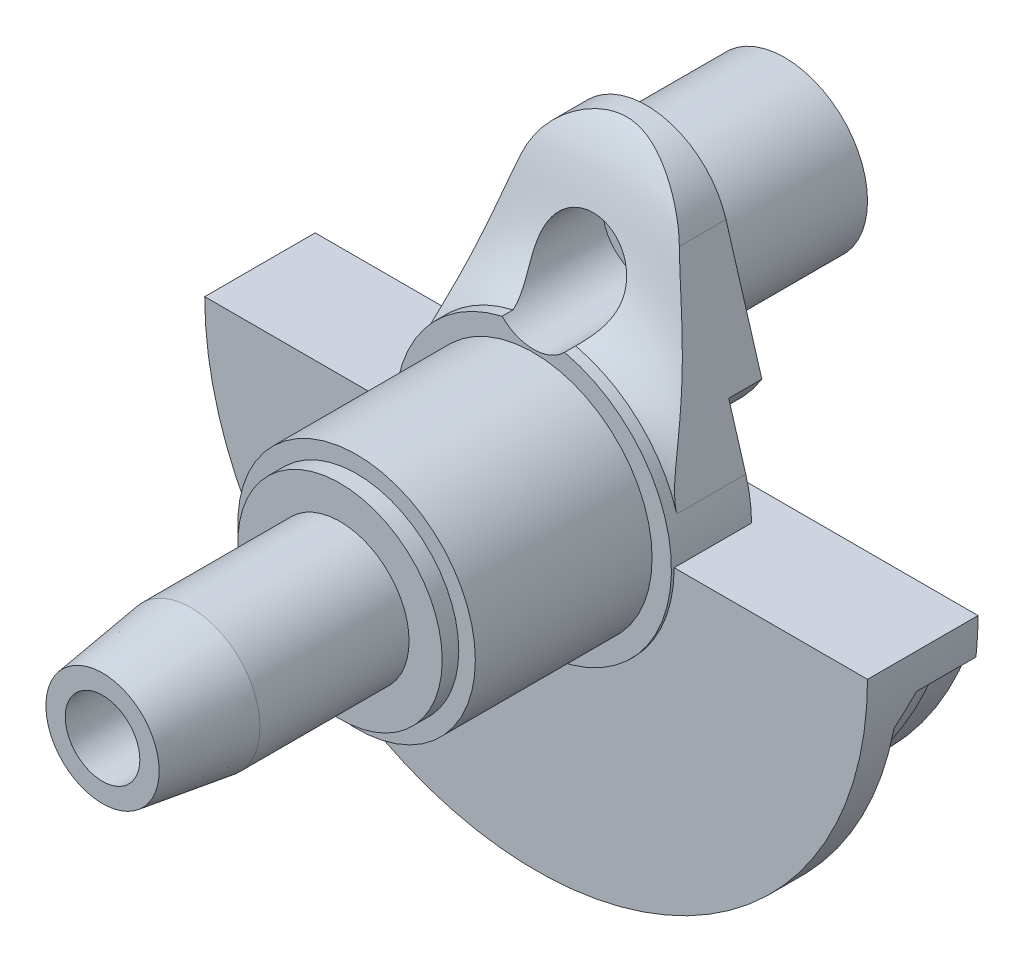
ISO-10303-21;
HEADER;
FILE_DESCRIPTION(('STEP AP214'),'2;1');
FILE_NAME('part.step','',(''),(''),'','','');
FILE_SCHEMA(('AUTOMOTIVE_DESIGN { 1 0 10303 214 1 1 1 1 }'));
ENDSEC;
DATA;
#1=APPLICATION_CONTEXT('core data for automotive mechanical design processes');
#2=APPLICATION_PROTOCOL_DEFINITION('international standard','automotive_design',2000,#1);
#3=PRODUCT_CONTEXT('',#1,'mechanical');
#4=PRODUCT('Part','Part','',(#3));
#5=PRODUCT_RELATED_PRODUCT_CATEGORY('part','',(#4));
#6=PRODUCT_DEFINITION_FORMATION('','',#4);
#7=PRODUCT_DEFINITION_CONTEXT('part definition',#1,'design');
#8=PRODUCT_DEFINITION('design','',#6,#7);
#9=PRODUCT_DEFINITION_SHAPE('','',#8);
#10=(LENGTH_UNIT() NAMED_UNIT(*) SI_UNIT(.MILLI.,.METRE.));
#11=(NAMED_UNIT(*) PLANE_ANGLE_UNIT() SI_UNIT($,.RADIAN.));
#12=(NAMED_UNIT(*) SI_UNIT($,.STERADIAN.) SOLID_ANGLE_UNIT());
#13=UNCERTAINTY_MEASURE_WITH_UNIT(LENGTH_MEASURE(1.E-05),#10,'distance_accuracy_value','');
#14=(GEOMETRIC_REPRESENTATION_CONTEXT(3) GLOBAL_UNCERTAINTY_ASSIGNED_CONTEXT((#13)) GLOBAL_UNIT_ASSIGNED_CONTEXT((#10,
#11,#12)) REPRESENTATION_CONTEXT('',''));
#15=CARTESIAN_POINT('',(0.,0.,0.));
#16=DIRECTION('',(0.,0.,1.));
#17=DIRECTION('',(1.,0.,0.));
#18=AXIS2_PLACEMENT_3D('',#15,#16,#17);
#19=CARTESIAN_POINT('',(0.,0.,-40.));
#20=DIRECTION('',(0.,0.,1.));
#21=DIRECTION('',(1.,0.,0.));
#22=AXIS2_PLACEMENT_3D('',#19,#20,#21);
#23=PLANE('',#22);
#24=CARTESIAN_POINT('',(0.,60.,-40.));
#25=DIRECTION('',(0.,0.,1.));
#26=DIRECTION('',(1.,0.,0.));
#27=AXIS2_PLACEMENT_3D('',#24,#25,#26);
#28=CIRCLE('',#27,30.);
#29=CARTESIAN_POINT('',(30.,60.,-40.));
#30=VERTEX_POINT('',#29);
#31=EDGE_CURVE('E407',#30,#30,#28,.F.);
#32=ORIENTED_EDGE('',*,*,#31,.F.);
#33=EDGE_LOOP('',(#32));
#34=FACE_BOUND('',#33,.T.);
#35=DIRECTION('',(-0.285714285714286,0.95831484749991,0.));
#36=VECTOR('',#35,1.);
#37=CARTESIAN_POINT('',(47.9157423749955,14.2857142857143,-40.));
#38=LINE('',#37,#36);
#39=CARTESIAN_POINT('',(41.7399355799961,35.,-40.));
#40=VERTEX_POINT('',#39);
#41=CARTESIAN_POINT('',(28.7494454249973,78.5714285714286,-40.));
#42=VERTEX_POINT('',#41);
#43=EDGE_CURVE('E430',#40,#42,#38,.T.);
#44=ORIENTED_EDGE('',*,*,#43,.F.);
#45=CARTESIAN_POINT('',(0.,60.,-40.));
#46=DIRECTION('',(0.,0.,1.));
#47=DIRECTION('',(-1.,0.,0.));
#48=AXIS2_PLACEMENT_3D('',#45,#46,#47);
#49=CIRCLE('',#48,48.6541079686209);
#50=CARTESIAN_POINT('',(-41.7399355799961,35.,-40.));
#51=VERTEX_POINT('',#50);
#52=EDGE_CURVE('E159',#51,#40,#49,.T.);
#53=ORIENTED_EDGE('',*,*,#52,.F.);
#54=DIRECTION('',(0.285714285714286,0.95831484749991,0.));
#55=VECTOR('',#54,1.);
#56=CARTESIAN_POINT('',(-47.9157423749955,14.2857142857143,-40.));
#57=LINE('',#56,#55);
#58=CARTESIAN_POINT('',(-28.7494454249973,78.5714285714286,-40.));
#59=VERTEX_POINT('',#58);
#60=EDGE_CURVE('E390',#51,#59,#57,.T.);
#61=ORIENTED_EDGE('',*,*,#60,.T.);
#62=CARTESIAN_POINT('',(0.,70.,-40.));
#63=DIRECTION('',(0.,0.,1.));
#64=DIRECTION('',(1.,0.,0.));
#65=AXIS2_PLACEMENT_3D('',#62,#63,#64);
#66=CIRCLE('',#65,30.);
#67=EDGE_CURVE('E434',#42,#59,#66,.T.);
#68=ORIENTED_EDGE('',*,*,#67,.F.);
#69=EDGE_LOOP('',(#44,#53,#61,#68));
#70=FACE_BOUND('',#69,.T.);
#71=ADVANCED_FACE('F35',(#34,#70),#23,.F.);
#72=CARTESIAN_POINT('',(0.,0.,-40.));
#73=DIRECTION('',(0.,0.,1.));
#74=DIRECTION('',(1.,0.,0.));
#75=AXIS2_PLACEMENT_3D('',#72,#73,#74);
#76=CYLINDRICAL_SURFACE('',#75,50.);
#77=DIRECTION('',(0.,0.,1.));
#78=VECTOR('',#77,1.);
#79=CARTESIAN_POINT('',(50.,0.,-308.328157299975));
#80=LINE('',#79,#78);
#81=CARTESIAN_POINT('',(50.,0.,-28.));
#82=VERTEX_POINT('',#81);
#83=CARTESIAN_POINT('',(50.,0.,0.));
#84=VERTEX_POINT('',#83);
#85=EDGE_CURVE('E403',#82,#84,#80,.T.);
#86=ORIENTED_EDGE('',*,*,#85,.F.);
#87=CARTESIAN_POINT('',(0.,0.,-28.));
#88=DIRECTION('',(0.,0.,-1.));
#89=DIRECTION('',(-1.,0.,0.));
#90=AXIS2_PLACEMENT_3D('',#87,#88,#89);
#91=CIRCLE('',#90,50.);
#92=CARTESIAN_POINT('',(47.9157423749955,14.2857142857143,-28.));
#93=VERTEX_POINT('',#92);
#94=EDGE_CURVE('E176',#93,#82,#91,.T.);
#95=ORIENTED_EDGE('',*,*,#94,.F.);
#96=DIRECTION('',(0.,0.,1.));
#97=VECTOR('',#96,1.);
#98=CARTESIAN_POINT('',(47.9157423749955,14.2857142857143,-308.328157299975));
#99=LINE('',#98,#97);
#100=CARTESIAN_POINT('',(47.9157423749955,14.2857142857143,-3.));
#101=VERTEX_POINT('',#100);
#102=EDGE_CURVE('E175',#93,#101,#99,.T.);
#103=ORIENTED_EDGE('',*,*,#102,.T.);
#104=CARTESIAN_POINT('',(0.,0.,-3.));
#105=DIRECTION('',(0.,0.,-1.));
#106=DIRECTION('',(-1.,0.,0.));
#107=AXIS2_PLACEMENT_3D('',#104,#105,#106);
#108=CIRCLE('',#107,50.);
#109=CARTESIAN_POINT('',(11.3274004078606,48.7,-3.));
#110=VERTEX_POINT('',#109);
#111=EDGE_CURVE('E232',#110,#101,#108,.T.);
#112=ORIENTED_EDGE('',*,*,#111,.F.);
#113=DIRECTION('',(0.,0.,-1.));
#114=VECTOR('',#113,1.);
#115=CARTESIAN_POINT('',(11.3274004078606,48.7,-19.5));
#116=LINE('',#115,#114);
#117=CARTESIAN_POINT('',(11.3274004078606,48.7,1.));
#118=VERTEX_POINT('',#117);
#119=EDGE_CURVE('E221',#118,#110,#116,.T.);
#120=ORIENTED_EDGE('',*,*,#119,.F.);
#121=CARTESIAN_POINT('',(0.,0.,1.));
#122=DIRECTION('',(0.,0.,1.));
#123=DIRECTION('',(1.,0.,0.));
#124=AXIS2_PLACEMENT_3D('',#121,#122,#123);
#125=CIRCLE('',#124,50.);
#126=CARTESIAN_POINT('',(-11.3274004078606,48.7,1.));
#127=VERTEX_POINT('',#126);
#128=EDGE_CURVE('E381',#127,#118,#125,.T.);
#129=ORIENTED_EDGE('',*,*,#128,.F.);
#130=DIRECTION('',(0.,0.,-1.));
#131=VECTOR('',#130,1.);
#132=CARTESIAN_POINT('',(-11.3274004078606,48.7,-19.5));
#133=LINE('',#132,#131);
#134=CARTESIAN_POINT('',(-11.3274004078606,48.7,-3.));
#135=VERTEX_POINT('',#134);
#136=EDGE_CURVE('E223',#135,#127,#133,.F.);
#137=ORIENTED_EDGE('',*,*,#136,.F.);
#138=CARTESIAN_POINT('',(-47.9157423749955,14.2857142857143,-3.));
#139=VERTEX_POINT('',#138);
#140=EDGE_CURVE('E239',#139,#135,#108,.T.);
#141=ORIENTED_EDGE('',*,*,#140,.F.);
#142=DIRECTION('',(0.,0.,1.));
#143=VECTOR('',#142,1.);
#144=CARTESIAN_POINT('',(-47.9157423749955,14.2857142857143,-308.328157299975));
#145=LINE('',#144,#143);
#146=CARTESIAN_POINT('',(-47.9157423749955,14.2857142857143,-28.));
#147=VERTEX_POINT('',#146);
#148=EDGE_CURVE('E422',#147,#139,#145,.T.);
#149=ORIENTED_EDGE('',*,*,#148,.F.);
#150=CARTESIAN_POINT('',(0.,0.,-28.));
#151=DIRECTION('',(0.,0.,-1.));
#152=DIRECTION('',(-1.,0.,0.));
#153=AXIS2_PLACEMENT_3D('',#150,#151,#152);
#154=CIRCLE('',#153,50.);
#155=CARTESIAN_POINT('',(-50.,0.,-28.));
#156=VERTEX_POINT('',#155);
#157=EDGE_CURVE('E50',#156,#147,#154,.T.);
#158=ORIENTED_EDGE('',*,*,#157,.F.);
#159=DIRECTION('',(0.,0.,1.));
#160=VECTOR('',#159,1.);
#161=CARTESIAN_POINT('',(-50.,0.,-308.328157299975));
#162=LINE('',#161,#160);
#163=CARTESIAN_POINT('',(-50.,0.,0.));
#164=VERTEX_POINT('',#163);
#165=EDGE_CURVE('E401',#156,#164,#162,.T.);
#166=ORIENTED_EDGE('',*,*,#165,.T.);
#167=CARTESIAN_POINT('',(0.,0.,0.));
#168=DIRECTION('',(0.,0.,1.));
#169=DIRECTION('',(1.,0.,0.));
#170=AXIS2_PLACEMENT_3D('',#167,#168,#169);
#171=CIRCLE('',#170,50.);
#172=EDGE_CURVE('E393',#164,#84,#171,.T.);
#173=ORIENTED_EDGE('',*,*,#172,.T.);
#174=EDGE_LOOP('',(#86,#95,#103,#112,#120,#129,#137,#141,#149,#158,#166,#173));
#175=FACE_BOUND('',#174,.T.);
#176=ADVANCED_FACE('F37',(#175),#76,.T.);
#177=DIRECTION('',(-1.,0.,0.));
#178=VECTOR('',#177,1.);
#179=CARTESIAN_POINT('',(0.,0.,-40.));
#180=LINE('',#179,#178);
#181=CARTESIAN_POINT('',(120.,0.,-40.));
#182=VERTEX_POINT('',#181);
#183=CARTESIAN_POINT('',(-120.,0.,-40.));
#184=VERTEX_POINT('',#183);
#185=EDGE_CURVE('E376',#182,#184,#180,.T.);
#186=ORIENTED_EDGE('',*,*,#185,.F.);
#187=CARTESIAN_POINT('',(0.,0.,-40.));
#188=DIRECTION('',(0.,0.,1.));
#189=DIRECTION('',(1.,0.,0.));
#190=AXIS2_PLACEMENT_3D('',#187,#188,#189);
#191=CIRCLE('',#190,120.);
#192=CARTESIAN_POINT('',(119.249134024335,-13.4031352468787,-40.));
#193=VERTEX_POINT('',#192);
#194=EDGE_CURVE('E374',#193,#182,#191,.T.);
#195=ORIENTED_EDGE('',*,*,#194,.F.);
#196=DIRECTION('',(-0.93969262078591,0.342020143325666,0.));
#197=VECTOR('',#196,1.);
#198=CARTESIAN_POINT('',(140.953893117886,-21.3030214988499,-40.));
#199=LINE('',#198,#197);
#200=CARTESIAN_POINT('',(116.521884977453,-12.4104977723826,-40.));
#201=VERTEX_POINT('',#200);
#202=EDGE_CURVE('E58',#193,#201,#199,.T.);
#203=ORIENTED_EDGE('',*,*,#202,.T.);
#204=CARTESIAN_POINT('',(0.,30.,-40.));
#205=DIRECTION('',(0.,0.,1.));
#206=DIRECTION('',(1.,0.,0.));
#207=AXIS2_PLACEMENT_3D('',#204,#205,#206);
#208=CIRCLE('',#207,124.);
#209=CARTESIAN_POINT('',(-116.521884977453,-12.4104977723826,-40.));
#210=VERTEX_POINT('',#209);
#211=EDGE_CURVE('E206',#210,#201,#208,.T.);
#212=ORIENTED_EDGE('',*,*,#211,.F.);
#213=DIRECTION('',(0.93969262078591,0.342020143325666,0.));
#214=VECTOR('',#213,1.);
#215=CARTESIAN_POINT('',(-140.953893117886,-21.3030214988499,-40.));
#216=LINE('',#215,#214);
#217=CARTESIAN_POINT('',(-119.249134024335,-13.4031352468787,-40.));
#218=VERTEX_POINT('',#217);
#219=EDGE_CURVE('E193',#218,#210,#216,.T.);
#220=ORIENTED_EDGE('',*,*,#219,.F.);
#221=EDGE_CURVE('E378',#184,#218,#191,.T.);
#222=ORIENTED_EDGE('',*,*,#221,.F.);
#223=EDGE_LOOP('',(#186,#195,#203,#212,#220,#222));
#224=FACE_BOUND('',#223,.T.);
#225=ADVANCED_FACE('F308',(#224),#23,.F.);
#226=CARTESIAN_POINT('',(0.,0.,-308.328157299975));
#227=DIRECTION('',(0.,0.,1.));
#228=DIRECTION('',(1.,0.,0.));
#229=AXIS2_PLACEMENT_3D('',#226,#227,#228);
#230=CYLINDRICAL_SURFACE('',#229,120.);
#231=DIRECTION('',(0.,0.,1.));
#232=VECTOR('',#231,1.);
#233=CARTESIAN_POINT('',(-119.249134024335,-13.4031352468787,-308.328157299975));
#234=LINE('',#233,#232);
#235=CARTESIAN_POINT('',(-119.249134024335,-13.4031352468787,-18.5070770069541));
#236=VERTEX_POINT('',#235);
#237=EDGE_CURVE('E11',#236,#218,#234,.F.);
#238=ORIENTED_EDGE('',*,*,#237,.F.);
#239=CARTESIAN_POINT('',(-119.356543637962,-12.4102977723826,-19.2754872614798));
#240=CARTESIAN_POINT('',(-119.270393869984,-13.2388434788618,-18.6336360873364));
#241=CARTESIAN_POINT('',(-119.175507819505,-14.0675458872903,-17.9931560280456));
#242=CARTESIAN_POINT('',(-118.968186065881,-15.724752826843,-16.7152914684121));
#243=CARTESIAN_POINT('',(-118.855755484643,-16.5532573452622,-16.0779061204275));
#244=CARTESIAN_POINT('',(-118.613217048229,-18.2100434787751,-14.8062076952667));
#245=CARTESIAN_POINT('',(-118.483109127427,-19.0383250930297,-14.1718946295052));
#246=CARTESIAN_POINT('',(-118.205067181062,-20.6946233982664,-12.9063296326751));
#247=CARTESIAN_POINT('',(-118.057127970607,-21.5226399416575,-12.2750786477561));
#248=CARTESIAN_POINT('',(-117.900236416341,-22.3502629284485,-11.6455369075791));
#249=B_SPLINE_CURVE_WITH_KNOTS('',3,(#239,#240,#241,#242,#243,#244,#245,#246,#247,#248),
.UNSPECIFIED.,.F.,.F.,(4,2,2,2,4),(0.,3.15479483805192,6.30867039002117,9.46255765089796,
12.6173642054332),.UNSPECIFIED.);
#250=CARTESIAN_POINT('',(-117.900286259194,-22.3500000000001,-11.6457369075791));
#251=VERTEX_POINT('',#250);
#252=EDGE_CURVE('E43',#236,#251,#249,.T.);
#253=ORIENTED_EDGE('',*,*,#252,.T.);
#254=CARTESIAN_POINT('',(0.,0.,-11.6457369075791));
#255=DIRECTION('',(0.,0.,1.));
#256=DIRECTION('',(1.,0.,0.));
#257=AXIS2_PLACEMENT_3D('',#254,#255,#256);
#258=CIRCLE('',#257,120.);
#259=CARTESIAN_POINT('',(117.900286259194,-22.3500000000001,-11.6457369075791));
#260=VERTEX_POINT('',#259);
#261=EDGE_CURVE('E323',#251,#260,#258,.T.);
#262=ORIENTED_EDGE('',*,*,#261,.T.);
#263=CARTESIAN_POINT('',(117.900236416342,-22.3502629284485,-11.6455369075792));
#264=CARTESIAN_POINT('',(118.057127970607,-21.5226399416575,-12.2750786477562));
#265=CARTESIAN_POINT('',(118.205067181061,-20.6946233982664,-12.9063296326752));
#266=CARTESIAN_POINT('',(118.483109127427,-19.0383250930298,-14.1718946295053));
#267=CARTESIAN_POINT('',(118.613217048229,-18.2100434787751,-14.8062076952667));
#268=CARTESIAN_POINT('',(118.855755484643,-16.5532573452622,-16.0779061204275));
#269=CARTESIAN_POINT('',(118.968186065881,-15.724752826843,-16.7152914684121));
#270=CARTESIAN_POINT('',(119.175507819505,-14.0675458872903,-17.9931560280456));
#271=CARTESIAN_POINT('',(119.270393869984,-13.2388434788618,-18.6336360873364));
#272=CARTESIAN_POINT('',(119.356543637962,-12.4102977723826,-19.2754872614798));
#273=B_SPLINE_CURVE_WITH_KNOTS('',3,(#263,#264,#265,#266,#267,#268,#269,#270,#271,#272),
.UNSPECIFIED.,.F.,.F.,(4,2,2,2,4),(0.,3.15480655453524,6.30869381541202,9.46256936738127,
12.6173642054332),.UNSPECIFIED.);
#274=CARTESIAN_POINT('',(119.249134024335,-13.4031352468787,-18.5070770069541));
#275=VERTEX_POINT('',#274);
#276=EDGE_CURVE('E312',#260,#275,#273,.T.);
#277=ORIENTED_EDGE('',*,*,#276,.T.);
#278=DIRECTION('',(0.,0.,1.));
#279=VECTOR('',#278,1.);
#280=CARTESIAN_POINT('',(119.249134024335,-13.4031352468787,-308.328157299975));
#281=LINE('',#280,#279);
#282=EDGE_CURVE('E361',#275,#193,#281,.F.);
#283=ORIENTED_EDGE('',*,*,#282,.T.);
#284=ORIENTED_EDGE('',*,*,#194,.T.);
#285=DIRECTION('',(0.,0.,1.));
#286=VECTOR('',#285,1.);
#287=CARTESIAN_POINT('',(120.,0.,-308.328157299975));
#288=LINE('',#287,#286);
#289=CARTESIAN_POINT('',(120.,0.,0.));
#290=VERTEX_POINT('',#289);
#291=EDGE_CURVE('E399',#182,#290,#288,.T.);
#292=ORIENTED_EDGE('',*,*,#291,.T.);
#293=CARTESIAN_POINT('',(0.,0.,0.));
#294=DIRECTION('',(0.,0.,1.));
#295=DIRECTION('',(1.,0.,0.));
#296=AXIS2_PLACEMENT_3D('',#293,#294,#295);
#297=CIRCLE('',#296,120.);
#298=CARTESIAN_POINT('',(-120.,0.,0.));
#299=VERTEX_POINT('',#298);
#300=EDGE_CURVE('E386',#290,#299,#297,.F.);
#301=ORIENTED_EDGE('',*,*,#300,.T.);
#302=DIRECTION('',(0.,0.,1.));
#303=VECTOR('',#302,1.);
#304=CARTESIAN_POINT('',(-120.,0.,-308.328157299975));
#305=LINE('',#304,#303);
#306=EDGE_CURVE('E382',#184,#299,#305,.T.);
#307=ORIENTED_EDGE('',*,*,#306,.F.);
#308=ORIENTED_EDGE('',*,*,#221,.T.);
#309=EDGE_LOOP('',(#238,#253,#262,#277,#283,#284,#292,#301,#307,#308));
#310=FACE_BOUND('',#309,.T.);
#311=ADVANCED_FACE('F304',(#310),#230,.T.);
#312=CARTESIAN_POINT('',(0.,0.,1.));
#313=DIRECTION('',(0.,0.,1.));
#314=DIRECTION('',(1.,0.,0.));
#315=AXIS2_PLACEMENT_3D('',#312,#313,#314);
#316=PLANE('',#315);
#317=CARTESIAN_POINT('',(0.,60.,1.));
#318=DIRECTION('',(0.,0.,1.));
#319=DIRECTION('',(1.,0.,0.));
#320=AXIS2_PLACEMENT_3D('',#317,#318,#319);
#321=CIRCLE('',#320,16.);
#322=EDGE_CURVE('E217',#118,#127,#321,.F.);
#323=ORIENTED_EDGE('',*,*,#322,.T.);
#324=ORIENTED_EDGE('',*,*,#128,.T.);
#325=EDGE_LOOP('',(#323,#324));
#326=FACE_BOUND('',#325,.T.);
#327=CARTESIAN_POINT('',(0.,0.,1.00000000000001));
#328=DIRECTION('',(0.,0.,1.));
#329=DIRECTION('',(1.,0.,0.));
#330=AXIS2_PLACEMENT_3D('',#327,#328,#329);
#331=CIRCLE('',#330,43.);
#332=CARTESIAN_POINT('',(43.,0.,1.00000000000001));
#333=VERTEX_POINT('',#332);
#334=EDGE_CURVE('E441',#333,#333,#331,.T.);
#335=ORIENTED_EDGE('',*,*,#334,.F.);
#336=EDGE_LOOP('',(#335));
#337=FACE_BOUND('',#336,.T.);
#338=ADVANCED_FACE('F302',(#326,#337),#316,.T.);
#339=CARTESIAN_POINT('',(0.,0.,-308.328157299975));
#340=DIRECTION('',(0.,-1.,0.));
#341=DIRECTION('',(0.,0.,-1.));
#342=AXIS2_PLACEMENT_3D('',#339,#340,#341);
#343=PLANE('',#342);
#344=DIRECTION('',(1.,0.,0.));
#345=VECTOR('',#344,1.);
#346=CARTESIAN_POINT('',(0.,0.,0.));
#347=LINE('',#346,#345);
#348=EDGE_CURVE('E396',#299,#164,#347,.T.);
#349=ORIENTED_EDGE('',*,*,#348,.T.);
#350=ORIENTED_EDGE('',*,*,#165,.F.);
#351=DIRECTION('',(-1.,0.,0.));
#352=VECTOR('',#351,1.);
#353=CARTESIAN_POINT('',(50.,0.,-28.));
#354=LINE('',#353,#352);
#355=EDGE_CURVE('E178',#82,#156,#354,.T.);
#356=ORIENTED_EDGE('',*,*,#355,.F.);
#357=ORIENTED_EDGE('',*,*,#85,.T.);
#358=DIRECTION('',(-1.,0.,0.));
#359=VECTOR('',#358,1.);
#360=CARTESIAN_POINT('',(0.,0.,0.));
#361=LINE('',#360,#359);
#362=EDGE_CURVE('E389',#290,#84,#361,.T.);
#363=ORIENTED_EDGE('',*,*,#362,.F.);
#364=ORIENTED_EDGE('',*,*,#291,.F.);
#365=ORIENTED_EDGE('',*,*,#185,.T.);
#366=ORIENTED_EDGE('',*,*,#306,.T.);
#367=EDGE_LOOP('',(#349,#350,#356,#357,#363,#364,#365,#366));
#368=FACE_BOUND('',#367,.T.);
#369=ADVANCED_FACE('F298',(#368),#343,.F.);
#370=CARTESIAN_POINT('',(0.,0.,0.));
#371=DIRECTION('',(0.,0.,1.));
#372=DIRECTION('',(1.,0.,0.));
#373=AXIS2_PLACEMENT_3D('',#370,#371,#372);
#374=PLANE('',#373);
#375=ORIENTED_EDGE('',*,*,#300,.F.);
#376=ORIENTED_EDGE('',*,*,#362,.T.);
#377=ORIENTED_EDGE('',*,*,#172,.F.);
#378=ORIENTED_EDGE('',*,*,#348,.F.);
#379=EDGE_LOOP('',(#375,#376,#377,#378));
#380=FACE_BOUND('',#379,.T.);
#381=ADVANCED_FACE('F294',(#380),#374,.T.);
#382=CARTESIAN_POINT('',(0.,70.,-308.328157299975));
#383=DIRECTION('',(0.,0.,1.));
#384=DIRECTION('',(1.,0.,0.));
#385=AXIS2_PLACEMENT_3D('',#382,#383,#384);
#386=CYLINDRICAL_SURFACE('',#385,30.);
#387=DIRECTION('',(0.,0.,1.));
#388=VECTOR('',#387,1.);
#389=CARTESIAN_POINT('',(-28.7494454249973,78.5714285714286,-308.328157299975));
#390=LINE('',#389,#388);
#391=CARTESIAN_POINT('',(-28.7494454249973,78.5714285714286,-23.10449605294));
#392=VERTEX_POINT('',#391);
#393=EDGE_CURVE('E440',#59,#392,#390,.T.);
#394=ORIENTED_EDGE('',*,*,#393,.T.);
#395=CARTESIAN_POINT('',(-28.7494454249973,78.5714285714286,-23.10449605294));
#396=CARTESIAN_POINT('',(-28.5814184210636,79.1351080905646,-23.2634919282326));
#397=CARTESIAN_POINT('',(-28.3968220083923,79.6936234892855,-23.4232643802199));
#398=CARTESIAN_POINT('',(-27.9954070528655,80.7982407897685,-23.7449240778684));
#399=CARTESIAN_POINT('',(-27.7785927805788,81.3443443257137,-23.906811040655));
#400=CARTESIAN_POINT('',(-27.3136243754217,82.4221785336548,-24.2332957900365));
#401=CARTESIAN_POINT('',(-27.0654716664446,82.9539098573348,-24.3978934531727));
#402=CARTESIAN_POINT('',(-26.5395851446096,83.9997148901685,-24.7297179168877));
#403=CARTESIAN_POINT('',(-26.2619344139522,84.513833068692,-24.8969362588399));
#404=CARTESIAN_POINT('',(-25.6776159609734,85.5241946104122,-25.2346435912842));
#405=CARTESIAN_POINT('',(-25.3709481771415,86.0204379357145,-25.4051325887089));
#406=CARTESIAN_POINT('',(-24.7297983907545,86.9934257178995,-25.7493953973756));
#407=CARTESIAN_POINT('',(-24.3953165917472,87.4701703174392,-25.9231691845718));
#408=CARTESIAN_POINT('',(-23.6998076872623,88.4026469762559,-26.2738158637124));
#409=CARTESIAN_POINT('',(-23.3387820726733,88.8583802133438,-26.4506885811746));
#410=CARTESIAN_POINT('',(-22.5914418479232,89.7475070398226,-26.8071600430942));
#411=CARTESIAN_POINT('',(-22.205126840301,90.1809002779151,-26.986758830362));
#412=CARTESIAN_POINT('',(-21.4084898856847,91.0241047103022,-27.348069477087));
#413=CARTESIAN_POINT('',(-20.9981677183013,91.4339156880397,-27.5297813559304));
#414=CARTESIAN_POINT('',(-20.1541150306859,92.2294513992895,-27.8947410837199));
#415=CARTESIAN_POINT('',(-19.7203488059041,92.615137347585,-28.0779908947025));
#416=CARTESIAN_POINT('',(-18.8312186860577,93.3606893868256,-28.4445967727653));
#417=CARTESIAN_POINT('',(-18.3758550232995,93.7205557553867,-28.6279528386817));
#418=CARTESIAN_POINT('',(-17.4446741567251,94.4135245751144,-28.9933126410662));
#419=CARTESIAN_POINT('',(-16.9688568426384,94.7466268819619,-29.1753163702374));
#420=CARTESIAN_POINT('',(-15.9902527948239,95.3901577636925,-29.5389757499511));
#421=CARTESIAN_POINT('',(-15.4871607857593,95.7001506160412,-29.7205815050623));
#422=CARTESIAN_POINT('',(-14.4620198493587,96.2906810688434,-30.0782057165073));
#423=CARTESIAN_POINT('',(-13.9399702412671,96.5712176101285,-30.2542239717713));
#424=CARTESIAN_POINT('',(-12.8778200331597,97.1019239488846,-30.5979089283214));
#425=CARTESIAN_POINT('',(-12.3377156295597,97.3520872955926,-30.7655738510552));
#426=CARTESIAN_POINT('',(-11.2415916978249,97.8205170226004,-31.088921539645));
#427=CARTESIAN_POINT('',(-10.685603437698,98.0388415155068,-31.244625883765));
#428=CARTESIAN_POINT('',(-9.55801339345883,98.4429783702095,-31.5406172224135));
#429=CARTESIAN_POINT('',(-8.98641445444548,98.6287966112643,-31.6809070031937));
#430=CARTESIAN_POINT('',(-7.82911617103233,98.9666713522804,-31.9419258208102));
#431=CARTESIAN_POINT('',(-7.24342267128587,99.1187415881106,-32.0626628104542));
#432=CARTESIAN_POINT('',(-6.22979916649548,99.3492210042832,-32.2490809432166));
#433=CARTESIAN_POINT('',(-5.80488305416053,99.4362412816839,-32.3206142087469));
#434=CARTESIAN_POINT('',(-4.94971145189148,99.5920459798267,-32.4501190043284));
#435=CARTESIAN_POINT('',(-4.51945679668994,99.6608332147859,-32.5080926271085));
#436=CARTESIAN_POINT('',(-3.65466685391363,99.7797564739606,-32.6091525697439));
#437=CARTESIAN_POINT('',(-3.22013190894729,99.8298939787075,-32.6522400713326));
#438=CARTESIAN_POINT('',(-2.34880069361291,99.9111052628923,-32.7223970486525));
#439=CARTESIAN_POINT('',(-1.91201009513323,99.942214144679,-32.749496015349));
#440=CARTESIAN_POINT('',(-1.03673034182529,99.9852831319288,-32.7870896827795));
#441=CARTESIAN_POINT('',(-0.598241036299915,99.9972414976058,-32.7975828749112));
#442=CARTESIAN_POINT('',(0.278912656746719,100.001908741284,-32.8016723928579));
#443=CARTESIAN_POINT('',(0.717577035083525,99.994618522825,-32.795269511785));
#444=CARTESIAN_POINT('',(1.48393671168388,99.9650791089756,-32.7694475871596));
#445=CARTESIAN_POINT('',(1.81192966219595,99.9470301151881,-32.7536869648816));
#446=CARTESIAN_POINT('',(2.46660785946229,99.9002264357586,-32.7130148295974));
#447=CARTESIAN_POINT('',(2.79329301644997,99.8714710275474,-32.6881026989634));
#448=CARTESIAN_POINT('',(3.44473479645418,99.8033729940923,-32.6294878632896));
#449=CARTESIAN_POINT('',(3.76949158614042,99.764031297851,-32.5957859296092));
#450=CARTESIAN_POINT('',(4.41660409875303,99.6749107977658,-32.5200592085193));
#451=CARTESIAN_POINT('',(4.7389595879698,99.6251309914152,-32.4780336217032));
#452=CARTESIAN_POINT('',(5.70301918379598,99.4601608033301,-32.3400846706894));
#453=CARTESIAN_POINT('',(6.34047999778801,99.3294696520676,-32.232403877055));
#454=CARTESIAN_POINT('',(7.60081680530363,99.0283939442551,-31.9907477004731));
#455=CARTESIAN_POINT('',(8.22369062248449,98.8580035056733,-31.8567684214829));
#456=CARTESIAN_POINT('',(9.37591357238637,98.5027877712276,-31.585796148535));
#457=CARTESIAN_POINT('',(9.90722928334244,98.3224214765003,-31.4512683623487));
#458=CARTESIAN_POINT('',(10.9560534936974,97.9334531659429,-31.1693568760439));
#459=CARTESIAN_POINT('',(11.4735588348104,97.7248447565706,-31.0219702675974));
#460=CARTESIAN_POINT('',(12.4937700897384,97.2803108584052,-30.7173636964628));
#461=CARTESIAN_POINT('',(12.9964744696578,97.0443825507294,-30.5601427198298));
#462=CARTESIAN_POINT('',(13.9864549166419,96.5459292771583,-30.2384409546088));
#463=CARTESIAN_POINT('',(14.4737230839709,96.2833909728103,-30.0739565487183));
#464=CARTESIAN_POINT('',(15.4316882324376,95.7326293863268,-29.7400923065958));
#465=CARTESIAN_POINT('',(15.9023872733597,95.4444093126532,-29.570713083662));
#466=CARTESIAN_POINT('',(16.8264196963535,94.8430164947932,-29.2289532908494));
#467=CARTESIAN_POINT('',(17.2797532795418,94.52984403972,-29.0565727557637));
#468=CARTESIAN_POINT('',(18.1733291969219,93.8755170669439,-28.7083763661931));
#469=CARTESIAN_POINT('',(18.6133574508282,93.5340790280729,-28.5325438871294));
#470=CARTESIAN_POINT('',(19.4737187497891,92.8272693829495,-28.1807618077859));
#471=CARTESIAN_POINT('',(19.8940513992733,92.4618972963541,-28.0048122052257));
#472=CARTESIAN_POINT('',(20.7139579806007,91.7081103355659,-27.6538588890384));
#473=CARTESIAN_POINT('',(21.1135314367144,91.3196949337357,-27.4788551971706));
#474=CARTESIAN_POINT('',(21.8905025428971,90.5211112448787,-27.1307519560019));
#475=CARTESIAN_POINT('',(22.2679169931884,90.110959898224,-26.9576510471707));
#476=CARTESIAN_POINT('',(22.9997633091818,89.2697094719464,-26.6138208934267));
#477=CARTESIAN_POINT('',(23.3541956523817,88.83861082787,-26.4430915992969));
#478=CARTESIAN_POINT('',(24.0389336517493,87.9566510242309,-26.1044117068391));
#479=CARTESIAN_POINT('',(24.3692407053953,87.5057910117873,-25.9364609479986));
#480=CARTESIAN_POINT('',(24.9834161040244,86.6162935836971,-25.6146634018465));
#481=CARTESIAN_POINT('',(25.2689125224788,86.1788490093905,-25.4606234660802));
#482=CARTESIAN_POINT('',(25.817046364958,85.2889886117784,-25.1551968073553));
#483=CARTESIAN_POINT('',(26.0796846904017,84.8365733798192,-25.0038099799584));
#484=CARTESIAN_POINT('',(26.5812666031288,83.9179777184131,-24.7036141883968));
#485=CARTESIAN_POINT('',(26.8202107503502,83.4517976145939,-24.5548051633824));
#486=CARTESIAN_POINT('',(27.2739225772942,82.5063367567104,-24.2593777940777));
#487=CARTESIAN_POINT('',(27.4886585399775,82.0270398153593,-24.1127625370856));
#488=CARTESIAN_POINT('',(27.8928807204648,81.0572645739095,-23.8216165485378));
#489=CARTESIAN_POINT('',(28.082365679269,80.5667857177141,-23.6770859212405));
#490=CARTESIAN_POINT('',(28.4354709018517,79.5760578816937,-23.3896646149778));
#491=CARTESIAN_POINT('',(28.5990878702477,79.0758076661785,-23.2467741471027));
#492=CARTESIAN_POINT('',(28.7494454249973,78.5714285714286,-23.10449605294));
#493=B_SPLINE_CURVE_WITH_KNOTS('',3,(#395,#396,#397,#398,#399,#400,#401,#402,#403,#404,#405,
#406,#407,#408,#409,#410,#411,#412,#413,#414,#415,#416,#417,#418,#419,#420,#421,#422,#423,#424,
#425,#426,#427,#428,#429,#430,#431,#432,#433,#434,#435,#436,#437,#438,#439,#440,#441,#442,#443,
#444,#445,#446,#447,#448,#449,#450,#451,#452,#453,#454,#455,#456,#457,#458,#459,#460,#461,#462,
#463,#464,#465,#466,#467,#468,#469,#470,#471,#472,#473,#474,#475,#476,#477,#478,#479,#480,#481,
#482,#483,#484,#485,#486,#487,#488,#489,#490,#491,#492),.UNSPECIFIED.,.F.,.F.,(4,2,2,2,2,2,2,2,
2,2,2,2,2,2,2,2,2,2,2,2,2,2,2,2,2,2,2,2,2,2,2,2,2,2,2,2,2,2,2,2,2,2,2,2,2,2,2,2,4),(0.,
1.82764851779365,3.65505499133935,5.48237846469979,7.30468521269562,9.12699582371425,
10.9492930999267,12.7714881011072,14.5937117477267,16.415952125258,18.2410505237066,
20.0661292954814,21.8912179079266,23.7448302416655,25.5985092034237,27.4525811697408,
29.3032255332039,31.1535348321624,33.003089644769,34.3213144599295,35.6393356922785,
36.957252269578,38.272730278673,39.5883277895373,40.9038635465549,41.8901746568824,
42.8765523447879,43.8628435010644,44.8492294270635,46.8257356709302,48.8025349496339,
50.5325015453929,52.2628604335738,53.9933980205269,55.7248073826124,57.4560007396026,
59.1871740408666,60.9385184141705,62.689897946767,64.4413175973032,66.1913917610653,
67.9414295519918,69.6913658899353,71.3244989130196,72.9575675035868,74.5905974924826,
76.2257427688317,77.86096954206,79.4964044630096),.UNSPECIFIED.);
#494=CARTESIAN_POINT('',(28.7494454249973,78.5714285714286,-23.10449605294));
#495=VERTEX_POINT('',#494);
#496=EDGE_CURVE('E267',#392,#495,#493,.T.);
#497=ORIENTED_EDGE('',*,*,#496,.T.);
#498=DIRECTION('',(0.,0.,1.));
#499=VECTOR('',#498,1.);
#500=CARTESIAN_POINT('',(28.7494454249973,78.5714285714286,-308.328157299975));
#501=LINE('',#500,#499);
#502=EDGE_CURVE('E429',#42,#495,#501,.T.);
#503=ORIENTED_EDGE('',*,*,#502,.F.);
#504=ORIENTED_EDGE('',*,*,#67,.T.);
#505=EDGE_LOOP('',(#394,#497,#503,#504));
#506=FACE_BOUND('',#505,.T.);
#507=ADVANCED_FACE('F285',(#506),#386,.T.);
#508=CARTESIAN_POINT('',(47.9157423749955,14.2857142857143,-308.328157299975));
#509=DIRECTION('',(-0.95831484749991,-0.285714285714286,0.));
#510=DIRECTION('',(0.285714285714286,-0.95831484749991,0.));
#511=AXIS2_PLACEMENT_3D('',#508,#509,#510);
#512=PLANE('',#511);
#513=DIRECTION('',(0.285714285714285,-0.95831484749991,0.));
#514=VECTOR('',#513,1.);
#515=CARTESIAN_POINT('',(41.7399355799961,35.,-28.));
#516=LINE('',#515,#514);
#517=CARTESIAN_POINT('',(41.7399355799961,35.,-28.));
#518=VERTEX_POINT('',#517);
#519=EDGE_CURVE('E168',#518,#93,#516,.T.);
#520=ORIENTED_EDGE('',*,*,#519,.F.);
#521=DIRECTION('',(0.,0.,-1.));
#522=VECTOR('',#521,1.);
#523=CARTESIAN_POINT('',(41.7399355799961,35.,-28.));
#524=LINE('',#523,#522);
#525=EDGE_CURVE('E154',#518,#40,#524,.T.);
#526=ORIENTED_EDGE('',*,*,#525,.T.);
#527=ORIENTED_EDGE('',*,*,#43,.T.);
#528=ORIENTED_EDGE('',*,*,#502,.T.);
#529=CARTESIAN_POINT('',(28.7494454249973,78.5714285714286,-23.10449605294));
#530=CARTESIAN_POINT('',(28.849861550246,78.2346226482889,-23.0094768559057));
#531=CARTESIAN_POINT('',(28.9503855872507,77.8974547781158,-22.9158670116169));
#532=CARTESIAN_POINT('',(29.1516180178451,77.2225006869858,-22.7311270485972));
#533=CARTESIAN_POINT('',(29.2523264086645,76.8847144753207,-22.6399968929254));
#534=CARTESIAN_POINT('',(29.5546709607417,75.8706200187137,-22.369826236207));
#535=CARTESIAN_POINT('',(29.7565409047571,75.1935276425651,-22.1939920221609));
#536=CARTESIAN_POINT('',(30.1611514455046,73.8364226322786,-21.8480871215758));
#537=CARTESIAN_POINT('',(30.3638929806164,73.1564068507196,-21.6780299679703));
#538=CARTESIAN_POINT('',(30.7696523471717,71.7954485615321,-21.341952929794));
#539=CARTESIAN_POINT('',(30.9726701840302,71.1145060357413,-21.1759331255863));
#540=CARTESIAN_POINT('',(31.3791532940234,69.7511202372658,-20.8457916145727));
#541=CARTESIAN_POINT('',(31.5826187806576,69.0686762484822,-20.6816731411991));
#542=CARTESIAN_POINT('',(31.9895793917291,67.703688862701,-20.3538866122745));
#543=CARTESIAN_POINT('',(32.1930745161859,67.0211454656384,-20.1902185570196));
#544=CARTESIAN_POINT('',(32.6001258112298,65.655853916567,-19.8616911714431));
#545=CARTESIAN_POINT('',(32.8036819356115,64.9731059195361,-19.6968311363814));
#546=CARTESIAN_POINT('',(33.2106298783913,63.6081610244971,-19.3646416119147));
#547=CARTESIAN_POINT('',(33.4140216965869,62.9259641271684,-19.1973121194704));
#548=CARTESIAN_POINT('',(34.0231000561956,60.8830532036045,-18.6902941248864));
#549=CARTESIAN_POINT('',(34.4284096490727,59.5236035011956,-18.3450046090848));
#550=CARTESIAN_POINT('',(35.2370365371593,56.8113864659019,-17.6310604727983));
#551=CARTESIAN_POINT('',(35.640355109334,55.4586148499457,-17.2624237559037));
#552=CARTESIAN_POINT('',(36.2433580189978,53.4360816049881,-16.6869091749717));
#553=CARTESIAN_POINT('',(36.4439306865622,52.7633404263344,-16.4914137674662));
#554=CARTESIAN_POINT('',(36.8444062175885,51.4201046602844,-16.0922013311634));
#555=CARTESIAN_POINT('',(37.0443090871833,50.7496100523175,-15.8884843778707));
#556=CARTESIAN_POINT('',(37.4431707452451,49.4117873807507,-15.4724794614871));
#557=CARTESIAN_POINT('',(37.6421302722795,48.7444568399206,-15.2602001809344));
#558=CARTESIAN_POINT('',(38.0392310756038,47.4125402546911,-14.8264808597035));
#559=CARTESIAN_POINT('',(38.2373723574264,46.7479541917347,-14.6050408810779));
#560=CARTESIAN_POINT('',(38.699556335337,45.1977420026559,-14.0763459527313));
#561=CARTESIAN_POINT('',(38.9632524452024,44.3132783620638,-13.7653694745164));
#562=CARTESIAN_POINT('',(39.4890323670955,42.5497588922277,-13.126343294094));
#563=CARTESIAN_POINT('',(39.7511157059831,41.6707046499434,-12.798288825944));
#564=CARTESIAN_POINT('',(40.2736494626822,39.9180731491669,-12.1256429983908));
#565=CARTESIAN_POINT('',(40.5340992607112,39.0444979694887,-11.7810457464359));
#566=CARTESIAN_POINT('',(41.0534362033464,37.3025889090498,-11.0766881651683));
#567=CARTESIAN_POINT('',(41.3123226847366,36.4342572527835,-10.7169218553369));
#568=CARTESIAN_POINT('',(41.6996089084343,35.1352597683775,-10.1678674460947));
#569=CARTESIAN_POINT('',(41.828551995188,34.7027715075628,-9.98324998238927));
#570=CARTESIAN_POINT('',(42.0861262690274,33.8388411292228,-9.61136805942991));
#571=CARTESIAN_POINT('',(42.2147574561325,33.4073990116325,-9.42410360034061));
#572=CARTESIAN_POINT('',(42.4717814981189,32.5453141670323,-9.04747392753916));
#573=CARTESIAN_POINT('',(42.6001743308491,32.1146715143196,-8.85810852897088));
#574=CARTESIAN_POINT('',(42.8567930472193,31.2539461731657,-8.47799790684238));
#575=CARTESIAN_POINT('',(42.9850189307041,30.8238634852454,-8.28725268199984));
#576=CARTESIAN_POINT('',(43.1990290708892,30.1060516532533,-7.96840571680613));
#577=CARTESIAN_POINT('',(43.2848300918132,29.8182662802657,-7.84044152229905));
#578=CARTESIAN_POINT('',(43.4564436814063,29.2426568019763,-7.58460882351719));
#579=CARTESIAN_POINT('',(43.5422562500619,28.9548326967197,-7.45674031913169));
#580=CARTESIAN_POINT('',(43.7139374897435,28.3789963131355,-7.20146418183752));
#581=CARTESIAN_POINT('',(43.7998061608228,28.0909840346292,-7.07405654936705));
#582=CARTESIAN_POINT('',(43.9716214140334,27.514698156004,-6.82017149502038));
#583=CARTESIAN_POINT('',(44.0575679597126,27.2264246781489,-6.69369377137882));
#584=CARTESIAN_POINT('',(44.2296263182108,26.6493233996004,-6.44212017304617));
#585=CARTESIAN_POINT('',(44.3157381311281,26.3604955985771,-6.31702429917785));
#586=CARTESIAN_POINT('',(44.4881941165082,25.7820606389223,-6.06879087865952));
#587=CARTESIAN_POINT('',(44.5745382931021,25.4924534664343,-5.94565336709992));
#588=CARTESIAN_POINT('',(44.7474072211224,24.9126334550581,-5.70218937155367));
#589=CARTESIAN_POINT('',(44.8339315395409,24.622422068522,-5.58185912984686));
#590=CARTESIAN_POINT('',(45.0073619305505,24.0407188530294,-5.34461819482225));
#591=CARTESIAN_POINT('',(45.0942679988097,23.7492270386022,-5.22770746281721));
#592=CARTESIAN_POINT('',(45.2685480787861,23.164673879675,-4.99822534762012));
#593=CARTESIAN_POINT('',(45.3559220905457,22.871612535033,-4.88565396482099));
#594=CARTESIAN_POINT('',(45.5311113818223,22.2840097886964,-4.66606678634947));
#595=CARTESIAN_POINT('',(45.6189259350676,21.9894708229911,-4.55904391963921));
#596=CARTESIAN_POINT('',(45.7951971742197,21.3982391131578,-4.35162773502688));
#597=CARTESIAN_POINT('',(45.8836538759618,21.1015463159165,-4.25123458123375));
#598=CARTESIAN_POINT('',(46.061300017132,20.505703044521,-4.05847002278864));
#599=CARTESIAN_POINT('',(46.1504895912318,20.2065521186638,-3.96610013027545));
#600=CARTESIAN_POINT('',(46.3300360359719,19.6043350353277,-3.79058879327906));
#601=CARTESIAN_POINT('',(46.4203963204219,19.3012574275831,-3.70748985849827));
#602=CARTESIAN_POINT('',(46.6019036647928,18.69246328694,-3.55272594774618));
#603=CARTESIAN_POINT('',(46.6930505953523,18.3867471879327,-3.48105912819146));
#604=CARTESIAN_POINT('',(46.8760694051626,17.7728834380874,-3.35094502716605));
#605=CARTESIAN_POINT('',(46.967940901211,17.4647370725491,-3.29249118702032));
#606=CARTESIAN_POINT('',(47.1543423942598,16.8395274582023,-3.18935431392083));
#607=CARTESIAN_POINT('',(47.2488871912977,16.5224145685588,-3.14499298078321));
#608=CARTESIAN_POINT('',(47.3911245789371,16.0453358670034,-3.09120298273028));
#609=CARTESIAN_POINT('',(47.4386253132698,15.8860135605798,-3.07539471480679));
#610=CARTESIAN_POINT('',(47.533730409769,15.5670213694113,-3.0481769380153));
#611=CARTESIAN_POINT('',(47.581334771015,15.4073514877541,-3.03676739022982));
#612=CARTESIAN_POINT('',(47.6767203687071,15.0874184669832,-3.01844039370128));
#613=CARTESIAN_POINT('',(47.7245017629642,14.9271547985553,-3.01153300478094));
#614=CARTESIAN_POINT('',(47.8201027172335,14.6064994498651,-3.00230873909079));
#615=CARTESIAN_POINT('',(47.8679222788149,14.4461077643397,-2.99999206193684));
#616=CARTESIAN_POINT('',(47.9157423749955,14.2857142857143,-3.));
#617=B_SPLINE_CURVE_WITH_KNOTS('',3,(#529,#530,#531,#532,#533,#534,#535,#536,#537,#538,#539,
#540,#541,#542,#543,#544,#545,#546,#547,#548,#549,#550,#551,#552,#553,#554,#555,#556,#557,#558,
#559,#560,#561,#562,#563,#564,#565,#566,#567,#568,#569,#570,#571,#572,#573,#574,#575,#576,#577,
#578,#579,#580,#581,#582,#583,#584,#585,#586,#587,#588,#589,#590,#591,#592,#593,#594,#595,#596,
#597,#598,#599,#600,#601,#602,#603,#604,#605,#606,#607,#608,#609,#610,#611,#612,#613,#614,#615,
#616),.UNSPECIFIED.,.F.,.F.,(4,2,2,2,2,2,2,2,2,2,2,2,2,2,2,2,2,2,2,2,2,2,2,2,2,2,2,2,2,2,2,2,2,
2,2,2,2,2,2,2,2,2,2,4),(0.,1.09221583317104,2.18441538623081,4.36865792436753,6.55770650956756,
8.74679863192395,10.9391860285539,13.1315748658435,15.3253877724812,17.5192033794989,
21.8990814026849,26.2756404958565,28.4617492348,30.6478379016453,32.8317629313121,
35.0156731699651,37.9372572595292,40.859661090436,43.7831137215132,46.7077299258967,
48.1705300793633,49.6333301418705,51.0962599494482,52.5591911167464,53.5384836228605,
54.517774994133,55.4970672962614,56.4760263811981,57.4549860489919,58.4339632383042,
59.4115445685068,60.3891148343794,61.366685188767,62.3429774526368,63.3192938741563,
64.2957939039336,65.2766018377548,66.2572514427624,67.2374131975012,68.2385645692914,
68.7395234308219,69.2404778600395,69.7425478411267,70.2446396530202),.UNSPECIFIED.);
#618=EDGE_CURVE('E273',#495,#101,#617,.T.);
#619=ORIENTED_EDGE('',*,*,#618,.T.);
#620=ORIENTED_EDGE('',*,*,#102,.F.);
#621=EDGE_LOOP('',(#520,#526,#527,#528,#619,#620));
#622=FACE_BOUND('',#621,.T.);
#623=ADVANCED_FACE('F173',(#622),#512,.F.);
#624=CARTESIAN_POINT('',(-47.9157423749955,14.2857142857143,-308.328157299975));
#625=DIRECTION('',(-0.95831484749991,0.285714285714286,0.));
#626=DIRECTION('',(-0.285714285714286,-0.95831484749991,0.));
#627=AXIS2_PLACEMENT_3D('',#624,#625,#626);
#628=PLANE('',#627);
#629=DIRECTION('',(0.,0.,-1.));
#630=VECTOR('',#629,1.);
#631=CARTESIAN_POINT('',(-41.7399355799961,35.,-28.));
#632=LINE('',#631,#630);
#633=CARTESIAN_POINT('',(-41.7399355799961,35.,-28.));
#634=VERTEX_POINT('',#633);
#635=EDGE_CURVE('E163',#634,#51,#632,.T.);
#636=ORIENTED_EDGE('',*,*,#635,.F.);
#637=DIRECTION('',(0.285714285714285,0.95831484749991,0.));
#638=VECTOR('',#637,1.);
#639=CARTESIAN_POINT('',(-41.7399355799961,35.,-28.));
#640=LINE('',#639,#638);
#641=EDGE_CURVE('E164',#147,#634,#640,.T.);
#642=ORIENTED_EDGE('',*,*,#641,.F.);
#643=ORIENTED_EDGE('',*,*,#148,.T.);
#644=CARTESIAN_POINT('',(-28.7494454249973,78.5714285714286,-23.10449605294));
#645=CARTESIAN_POINT('',(-28.8498615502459,78.2346226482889,-23.0094768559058));
#646=CARTESIAN_POINT('',(-28.9503855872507,77.8974547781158,-22.9158670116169));
#647=CARTESIAN_POINT('',(-29.1516180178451,77.2225006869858,-22.7311270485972));
#648=CARTESIAN_POINT('',(-29.2523264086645,76.8847144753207,-22.6399968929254));
#649=CARTESIAN_POINT('',(-29.5546709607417,75.8706200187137,-22.369826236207));
#650=CARTESIAN_POINT('',(-29.7565409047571,75.1935276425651,-22.1939920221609));
#651=CARTESIAN_POINT('',(-30.1611514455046,73.8364226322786,-21.8480871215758));
#652=CARTESIAN_POINT('',(-30.3638929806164,73.1564068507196,-21.6780299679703));
#653=CARTESIAN_POINT('',(-30.7696523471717,71.7954485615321,-21.341952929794));
#654=CARTESIAN_POINT('',(-30.9726701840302,71.1145060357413,-21.1759331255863));
#655=CARTESIAN_POINT('',(-31.3791532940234,69.7511202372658,-20.8457916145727));
#656=CARTESIAN_POINT('',(-31.5826187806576,69.0686762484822,-20.6816731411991));
#657=CARTESIAN_POINT('',(-31.9895793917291,67.703688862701,-20.3538866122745));
#658=CARTESIAN_POINT('',(-32.1930745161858,67.0211454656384,-20.1902185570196));
#659=CARTESIAN_POINT('',(-32.6001258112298,65.655853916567,-19.8616911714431));
#660=CARTESIAN_POINT('',(-32.8036819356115,64.9731059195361,-19.6968311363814));
#661=CARTESIAN_POINT('',(-33.2106298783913,63.6081610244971,-19.3646416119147));
#662=CARTESIAN_POINT('',(-33.4140216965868,62.9259641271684,-19.1973121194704));
#663=CARTESIAN_POINT('',(-34.0231000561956,60.8830532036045,-18.6902941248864));
#664=CARTESIAN_POINT('',(-34.4284096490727,59.5236035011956,-18.3450046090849));
#665=CARTESIAN_POINT('',(-35.2370365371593,56.8113864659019,-17.6310604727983));
#666=CARTESIAN_POINT('',(-35.640355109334,55.4586148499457,-17.2624237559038));
#667=CARTESIAN_POINT('',(-36.2433580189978,53.4360816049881,-16.6869091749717));
#668=CARTESIAN_POINT('',(-36.4439306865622,52.7633404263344,-16.4914137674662));
#669=CARTESIAN_POINT('',(-36.8444062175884,51.4201046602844,-16.0922013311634));
#670=CARTESIAN_POINT('',(-37.0443090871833,50.7496100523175,-15.8884843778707));
#671=CARTESIAN_POINT('',(-37.4431707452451,49.4117873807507,-15.4724794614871));
#672=CARTESIAN_POINT('',(-37.6421302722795,48.7444568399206,-15.2602001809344));
#673=CARTESIAN_POINT('',(-38.0392310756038,47.4125402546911,-14.8264808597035));
#674=CARTESIAN_POINT('',(-38.2373723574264,46.7479541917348,-14.6050408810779));
#675=CARTESIAN_POINT('',(-38.6995563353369,45.1977420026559,-14.0763459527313));
#676=CARTESIAN_POINT('',(-38.9632524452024,44.3132783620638,-13.7653694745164));
#677=CARTESIAN_POINT('',(-39.4890323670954,42.5497588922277,-13.126343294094));
#678=CARTESIAN_POINT('',(-39.7511157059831,41.6707046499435,-12.798288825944));
#679=CARTESIAN_POINT('',(-40.2736494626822,39.9180731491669,-12.1256429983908));
#680=CARTESIAN_POINT('',(-40.5340992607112,39.0444979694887,-11.7810457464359));
#681=CARTESIAN_POINT('',(-41.0534362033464,37.3025889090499,-11.0766881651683));
#682=CARTESIAN_POINT('',(-41.3123226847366,36.4342572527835,-10.7169218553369));
#683=CARTESIAN_POINT('',(-41.6996089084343,35.1352597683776,-10.1678674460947));
#684=CARTESIAN_POINT('',(-41.828551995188,34.7027715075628,-9.98324998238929));
#685=CARTESIAN_POINT('',(-42.0861262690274,33.8388411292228,-9.61136805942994));
#686=CARTESIAN_POINT('',(-42.2147574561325,33.4073990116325,-9.42410360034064));
#687=CARTESIAN_POINT('',(-42.4717814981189,32.5453141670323,-9.04747392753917));
#688=CARTESIAN_POINT('',(-42.6001743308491,32.1146715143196,-8.85810852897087));
#689=CARTESIAN_POINT('',(-42.8567930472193,31.2539461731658,-8.47799790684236));
#690=CARTESIAN_POINT('',(-42.9850189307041,30.8238634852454,-8.28725268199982));
#691=CARTESIAN_POINT('',(-43.1990290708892,30.1060516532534,-7.96840571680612));
#692=CARTESIAN_POINT('',(-43.2848300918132,29.8182662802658,-7.84044152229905));
#693=CARTESIAN_POINT('',(-43.4564436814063,29.2426568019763,-7.58460882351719));
#694=CARTESIAN_POINT('',(-43.5422562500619,28.9548326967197,-7.45674031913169));
#695=CARTESIAN_POINT('',(-43.7139374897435,28.3789963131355,-7.20146418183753));
#696=CARTESIAN_POINT('',(-43.7998061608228,28.0909840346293,-7.07405654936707));
#697=CARTESIAN_POINT('',(-43.9716214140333,27.514698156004,-6.82017149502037));
#698=CARTESIAN_POINT('',(-44.0575679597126,27.2264246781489,-6.69369377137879));
#699=CARTESIAN_POINT('',(-44.2296263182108,26.6493233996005,-6.44212017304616));
#700=CARTESIAN_POINT('',(-44.3157381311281,26.3604955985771,-6.31702429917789));
#701=CARTESIAN_POINT('',(-44.4881941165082,25.7820606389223,-6.06879087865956));
#702=CARTESIAN_POINT('',(-44.5745382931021,25.4924534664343,-5.94565336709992));
#703=CARTESIAN_POINT('',(-44.7474072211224,24.9126334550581,-5.70218937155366));
#704=CARTESIAN_POINT('',(-44.8339315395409,24.6224220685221,-5.58185912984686));
#705=CARTESIAN_POINT('',(-45.0073619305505,24.0407188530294,-5.34461819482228));
#706=CARTESIAN_POINT('',(-45.0942679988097,23.7492270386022,-5.22770746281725));
#707=CARTESIAN_POINT('',(-45.2685480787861,23.164673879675,-4.99822534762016));
#708=CARTESIAN_POINT('',(-45.3559220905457,22.871612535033,-4.88565396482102));
#709=CARTESIAN_POINT('',(-45.5311113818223,22.2840097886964,-4.66606678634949));
#710=CARTESIAN_POINT('',(-45.6189259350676,21.9894708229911,-4.55904391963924));
#711=CARTESIAN_POINT('',(-45.7951971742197,21.3982391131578,-4.35162773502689));
#712=CARTESIAN_POINT('',(-45.8836538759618,21.1015463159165,-4.25123458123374));
#713=CARTESIAN_POINT('',(-46.0613000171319,20.505703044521,-4.05847002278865));
#714=CARTESIAN_POINT('',(-46.1504895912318,20.2065521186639,-3.9661001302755));
#715=CARTESIAN_POINT('',(-46.3300360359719,19.6043350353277,-3.79058879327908));
#716=CARTESIAN_POINT('',(-46.4203963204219,19.3012574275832,-3.70748985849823));
#717=CARTESIAN_POINT('',(-46.6019036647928,18.69246328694,-3.55272594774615));
#718=CARTESIAN_POINT('',(-46.6930505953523,18.3867471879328,-3.48105912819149));
#719=CARTESIAN_POINT('',(-46.8760694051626,17.7728834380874,-3.35094502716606));
#720=CARTESIAN_POINT('',(-46.967940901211,17.4647370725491,-3.29249118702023));
#721=CARTESIAN_POINT('',(-47.1543423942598,16.8395274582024,-3.18935431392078));
#722=CARTESIAN_POINT('',(-47.2488871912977,16.5224145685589,-3.1449929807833));
#723=CARTESIAN_POINT('',(-47.391124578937,16.0453358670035,-3.09120298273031));
#724=CARTESIAN_POINT('',(-47.4386253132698,15.8860135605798,-3.07539471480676));
#725=CARTESIAN_POINT('',(-47.533730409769,15.5670213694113,-3.04817693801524));
#726=CARTESIAN_POINT('',(-47.581334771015,15.4073514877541,-3.03676739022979));
#727=CARTESIAN_POINT('',(-47.676720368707,15.0874184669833,-3.01844039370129));
#728=CARTESIAN_POINT('',(-47.7245017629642,14.9271547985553,-3.01153300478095));
#729=CARTESIAN_POINT('',(-47.8201027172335,14.6064994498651,-3.00230873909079));
#730=CARTESIAN_POINT('',(-47.8679222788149,14.4461077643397,-2.99999206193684));
#731=CARTESIAN_POINT('',(-47.9157423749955,14.2857142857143,-3.));
#732=B_SPLINE_CURVE_WITH_KNOTS('',3,(#644,#645,#646,#647,#648,#649,#650,#651,#652,#653,#654,
#655,#656,#657,#658,#659,#660,#661,#662,#663,#664,#665,#666,#667,#668,#669,#670,#671,#672,#673,
#674,#675,#676,#677,#678,#679,#680,#681,#682,#683,#684,#685,#686,#687,#688,#689,#690,#691,#692,
#693,#694,#695,#696,#697,#698,#699,#700,#701,#702,#703,#704,#705,#706,#707,#708,#709,#710,#711,
#712,#713,#714,#715,#716,#717,#718,#719,#720,#721,#722,#723,#724,#725,#726,#727,#728,#729,#730,
#731),.UNSPECIFIED.,.F.,.F.,(4,2,2,2,2,2,2,2,2,2,2,2,2,2,2,2,2,2,2,2,2,2,2,2,2,2,2,2,2,2,2,2,2,
2,2,2,2,2,2,2,2,2,2,4),(0.,1.09221583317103,2.1844153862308,4.36865792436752,6.55770650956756,
8.74679863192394,10.9391860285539,13.1315748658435,15.3253877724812,17.5192033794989,
21.8990814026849,26.2756404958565,28.4617492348,30.6478379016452,32.831762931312,
35.0156731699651,37.9372572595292,40.8596610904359,43.7831137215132,46.7077299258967,
48.1705300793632,49.6333301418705,51.0962599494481,52.5591911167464,53.5384836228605,
54.517774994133,55.4970672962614,56.4760263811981,57.4549860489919,58.4339632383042,
59.4115445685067,60.3891148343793,61.366685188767,62.3429774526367,63.3192938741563,
64.2957939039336,65.2766018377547,66.2572514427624,67.2374131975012,68.2385645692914,
68.7395234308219,69.2404778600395,69.7425478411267,70.2446396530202),.UNSPECIFIED.);
#733=EDGE_CURVE('E258',#392,#139,#732,.T.);
#734=ORIENTED_EDGE('',*,*,#733,.F.);
#735=ORIENTED_EDGE('',*,*,#393,.F.);
#736=ORIENTED_EDGE('',*,*,#60,.F.);
#737=EDGE_LOOP('',(#636,#642,#643,#734,#735,#736));
#738=FACE_BOUND('',#737,.T.);
#739=ADVANCED_FACE('F284',(#738),#628,.T.);
#740=CARTESIAN_POINT('',(0.,0.,125.));
#741=DIRECTION('',(0.,0.,1.));
#742=DIRECTION('',(1.,0.,0.));
#743=AXIS2_PLACEMENT_3D('',#740,#741,#742);
#744=CYLINDRICAL_SURFACE('',#743,43.);
#745=CARTESIAN_POINT('',(0.,0.,65.));
#746=DIRECTION('',(0.,0.,1.));
#747=DIRECTION('',(1.,0.,0.));
#748=AXIS2_PLACEMENT_3D('',#745,#746,#747);
#749=CIRCLE('',#748,43.);
#750=CARTESIAN_POINT('',(43.,0.,65.));
#751=VERTEX_POINT('',#750);
#752=EDGE_CURVE('E743',#751,#751,#749,.T.);
#753=ORIENTED_EDGE('',*,*,#752,.F.);
#754=EDGE_LOOP('',(#753));
#755=FACE_BOUND('',#754,.T.);
#756=ORIENTED_EDGE('',*,*,#334,.T.);
#757=EDGE_LOOP('',(#756));
#758=FACE_BOUND('',#757,.T.);
#759=ADVANCED_FACE('F286',(#755,#758),#744,.T.);
#760=CARTESIAN_POINT('',(0.,43.,65.));
#761=DIRECTION('',(0.,0.,-1.));
#762=DIRECTION('',(-1.,0.,0.));
#763=AXIS2_PLACEMENT_3D('',#760,#761,#762);
#764=PLANE('',#763);
#765=CARTESIAN_POINT('',(0.,0.,65.));
#766=DIRECTION('',(0.,0.,1.));
#767=DIRECTION('',(1.,0.,0.));
#768=AXIS2_PLACEMENT_3D('',#765,#766,#767);
#769=CIRCLE('',#768,37.);
#770=CARTESIAN_POINT('',(37.,0.,65.));
#771=VERTEX_POINT('',#770);
#772=EDGE_CURVE('E740',#771,#771,#769,.T.);
#773=ORIENTED_EDGE('',*,*,#772,.F.);
#774=EDGE_LOOP('',(#773));
#775=FACE_BOUND('',#774,.T.);
#776=ORIENTED_EDGE('',*,*,#752,.T.);
#777=EDGE_LOOP('',(#776));
#778=FACE_BOUND('',#777,.T.);
#779=ADVANCED_FACE('F575',(#775,#778),#764,.F.);
#780=CARTESIAN_POINT('',(0.,0.,125.));
#781=DIRECTION('',(0.,0.,1.));
#782=DIRECTION('',(1.,0.,0.));
#783=AXIS2_PLACEMENT_3D('',#780,#781,#782);
#784=CYLINDRICAL_SURFACE('',#783,37.);
#785=CARTESIAN_POINT('',(0.,0.,71.));
#786=DIRECTION('',(0.,0.,1.));
#787=DIRECTION('',(1.,0.,0.));
#788=AXIS2_PLACEMENT_3D('',#785,#786,#787);
#789=CIRCLE('',#788,37.);
#790=CARTESIAN_POINT('',(37.,0.,71.));
#791=VERTEX_POINT('',#790);
#792=EDGE_CURVE('E737',#791,#791,#789,.T.);
#793=ORIENTED_EDGE('',*,*,#792,.F.);
#794=EDGE_LOOP('',(#793));
#795=FACE_BOUND('',#794,.T.);
#796=ORIENTED_EDGE('',*,*,#772,.T.);
#797=EDGE_LOOP('',(#796));
#798=FACE_BOUND('',#797,.T.);
#799=ADVANCED_FACE('F583',(#795,#798),#784,.T.);
#800=CARTESIAN_POINT('',(0.,37.,71.));
#801=DIRECTION('',(0.,0.,-1.));
#802=DIRECTION('',(-1.,0.,0.));
#803=AXIS2_PLACEMENT_3D('',#800,#801,#802);
#804=PLANE('',#803);
#805=CARTESIAN_POINT('',(0.,0.,71.));
#806=DIRECTION('',(0.,0.,1.));
#807=DIRECTION('',(1.,0.,0.));
#808=AXIS2_PLACEMENT_3D('',#805,#806,#807);
#809=CIRCLE('',#808,25.);
#810=CARTESIAN_POINT('',(25.,0.,71.));
#811=VERTEX_POINT('',#810);
#812=EDGE_CURVE('E732',#811,#811,#809,.T.);
#813=ORIENTED_EDGE('',*,*,#812,.F.);
#814=EDGE_LOOP('',(#813));
#815=FACE_BOUND('',#814,.T.);
#816=ORIENTED_EDGE('',*,*,#792,.T.);
#817=EDGE_LOOP('',(#816));
#818=FACE_BOUND('',#817,.T.);
#819=ADVANCED_FACE('F591',(#815,#818),#804,.F.);
#820=CARTESIAN_POINT('',(0.,0.,125.));
#821=DIRECTION('',(0.,0.,1.));
#822=DIRECTION('',(1.,0.,0.));
#823=AXIS2_PLACEMENT_3D('',#820,#821,#822);
#824=CYLINDRICAL_SURFACE('',#823,25.);
#825=CARTESIAN_POINT('',(0.,0.,125.));
#826=DIRECTION('',(0.,0.,1.));
#827=DIRECTION('',(1.,0.,0.));
#828=AXIS2_PLACEMENT_3D('',#825,#826,#827);
#829=CIRCLE('',#828,25.);
#830=CARTESIAN_POINT('',(25.,0.,125.));
#831=VERTEX_POINT('',#830);
#832=EDGE_CURVE('E728',#831,#831,#829,.T.);
#833=ORIENTED_EDGE('',*,*,#832,.F.);
#834=EDGE_LOOP('',(#833));
#835=FACE_BOUND('',#834,.T.);
#836=ORIENTED_EDGE('',*,*,#812,.T.);
#837=EDGE_LOOP('',(#836));
#838=FACE_BOUND('',#837,.T.);
#839=ADVANCED_FACE('F600',(#835,#838),#824,.T.);
#840=CARTESIAN_POINT('',(0.,0.,125.));
#841=DIRECTION('',(0.,0.,-1.));
#842=DIRECTION('',(1.,0.,0.));
#843=AXIS2_PLACEMENT_3D('',#840,#841,#842);
#844=CONICAL_SURFACE('',#843,25.,0.139626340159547);
#845=CARTESIAN_POINT('',(0.,0.,157.));
#846=DIRECTION('',(0.,0.,1.));
#847=DIRECTION('',(1.,0.,0.));
#848=AXIS2_PLACEMENT_3D('',#845,#846,#847);
#849=CIRCLE('',#848,20.5026932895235);
#850=CARTESIAN_POINT('',(20.5026932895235,0.,157.));
#851=VERTEX_POINT('',#850);
#852=EDGE_CURVE('E726',#851,#851,#849,.T.);
#853=ORIENTED_EDGE('',*,*,#852,.F.);
#854=EDGE_LOOP('',(#853));
#855=FACE_BOUND('',#854,.T.);
#856=ORIENTED_EDGE('',*,*,#832,.T.);
#857=EDGE_LOOP('',(#856));
#858=FACE_BOUND('',#857,.T.);
#859=ADVANCED_FACE('F609',(#855,#858),#844,.T.);
#860=CARTESIAN_POINT('',(0.,0.,157.));
#861=DIRECTION('',(0.,0.,1.));
#862=DIRECTION('',(1.,0.,0.));
#863=AXIS2_PLACEMENT_3D('',#860,#861,#862);
#864=PLANE('',#863);
#865=CARTESIAN_POINT('',(0.,0.,157.));
#866=DIRECTION('',(0.,0.,1.));
#867=DIRECTION('',(1.,0.,0.));
#868=AXIS2_PLACEMENT_3D('',#865,#866,#867);
#869=CIRCLE('',#868,13.5026932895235);
#870=CARTESIAN_POINT('',(13.5026932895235,0.,157.));
#871=VERTEX_POINT('',#870);
#872=EDGE_CURVE('E208',#871,#871,#869,.T.);
#873=ORIENTED_EDGE('',*,*,#872,.F.);
#874=EDGE_LOOP('',(#873));
#875=FACE_BOUND('',#874,.T.);
#876=ORIENTED_EDGE('',*,*,#852,.T.);
#877=EDGE_LOOP('',(#876));
#878=FACE_BOUND('',#877,.T.);
#879=ADVANCED_FACE('F618',(#875,#878),#864,.T.);
#880=CARTESIAN_POINT('',(0.,60.,-90.));
#881=DIRECTION('',(0.,0.,1.));
#882=DIRECTION('',(1.,0.,0.));
#883=AXIS2_PLACEMENT_3D('',#880,#881,#882);
#884=CYLINDRICAL_SURFACE('',#883,30.);
#885=CARTESIAN_POINT('',(0.,60.,-90.));
#886=DIRECTION('',(0.,0.,-1.));
#887=DIRECTION('',(-1.,0.,0.));
#888=AXIS2_PLACEMENT_3D('',#885,#886,#887);
#889=CIRCLE('',#888,30.);
#890=CARTESIAN_POINT('',(-30.,60.,-90.));
#891=VERTEX_POINT('',#890);
#892=EDGE_CURVE('E279',#891,#891,#889,.T.);
#893=ORIENTED_EDGE('',*,*,#892,.F.);
#894=EDGE_LOOP('',(#893));
#895=FACE_BOUND('',#894,.T.);
#896=ORIENTED_EDGE('',*,*,#31,.T.);
#897=EDGE_LOOP('',(#896));
#898=FACE_BOUND('',#897,.T.);
#899=ADVANCED_FACE('F627',(#895,#898),#884,.T.);
#900=CARTESIAN_POINT('',(0.,60.,-90.));
#901=DIRECTION('',(0.,0.,-1.));
#902=DIRECTION('',(-1.,0.,0.));
#903=AXIS2_PLACEMENT_3D('',#900,#901,#902);
#904=PLANE('',#903);
#905=CARTESIAN_POINT('',(0.,60.,-90.));
#906=DIRECTION('',(0.,0.,-1.));
#907=DIRECTION('',(-1.,0.,0.));
#908=AXIS2_PLACEMENT_3D('',#905,#906,#907);
#909=CIRCLE('',#908,21.);
#910=CARTESIAN_POINT('',(-21.,60.,-90.));
#911=VERTEX_POINT('',#910);
#912=EDGE_CURVE('E228',#911,#911,#909,.T.);
#913=ORIENTED_EDGE('',*,*,#912,.F.);
#914=EDGE_LOOP('',(#913));
#915=FACE_BOUND('',#914,.T.);
#916=ORIENTED_EDGE('',*,*,#892,.T.);
#917=EDGE_LOOP('',(#916));
#918=FACE_BOUND('',#917,.T.);
#919=ADVANCED_FACE('F251',(#915,#918),#904,.T.);
#920=CARTESIAN_POINT('',(-50.,-1.74574066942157E-13,-3.));
#921=CARTESIAN_POINT('',(-56.1874939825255,-1.96177586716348E-13,-20.));
#922=CARTESIAN_POINT('',(-78.5714285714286,-2.74330676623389E-13,-20.));
#923=CARTESIAN_POINT('',(-92.9714285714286,-3.2460800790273E-13,-24.));
#924=CARTESIAN_POINT('',(-100.,-3.49148133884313E-13,-32.8));
#925=B_SPLINE_CURVE_WITH_KNOTS('',4,(#920,#921,#922,#923,#924),.UNSPECIFIED.,.F.,.F.,(5,5),(0.,
1.),.UNSPECIFIED.);
#926=CARTESIAN_POINT('',(0.,0.,-40.));
#927=DIRECTION('',(0.,0.,-1.));
#928=AXIS1_PLACEMENT('',#926,#927);
#929=SURFACE_OF_REVOLUTION('',#925,#928);
#930=ORIENTED_EDGE('',*,*,#140,.T.);
#931=CARTESIAN_POINT('',(-11.3274004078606,48.7,-3.));
#932=CARTESIAN_POINT('',(-11.42240472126,48.7952480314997,-3.31406653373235));
#933=CARTESIAN_POINT('',(-11.5215514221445,48.8970243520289,-3.62489656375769));
#934=CARTESIAN_POINT('',(-11.7267946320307,49.1140146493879,-4.23961128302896));
#935=CARTESIAN_POINT('',(-11.8328932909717,49.2292327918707,-4.54349378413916));
#936=CARTESIAN_POINT('',(-12.0506656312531,49.473452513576,-5.14370288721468));
#937=CARTESIAN_POINT('',(-12.162340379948,49.6024567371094,-5.44002802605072));
#938=CARTESIAN_POINT('',(-12.3897607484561,49.8745237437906,-6.02458676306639));
#939=CARTESIAN_POINT('',(-12.5055067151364,50.0175877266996,-6.31281966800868));
#940=CARTESIAN_POINT('',(-12.7395843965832,50.3180949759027,-6.88092563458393));
#941=CARTESIAN_POINT('',(-12.8579179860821,50.4755489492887,-7.16079226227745));
#942=CARTESIAN_POINT('',(-13.0954306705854,50.8048438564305,-7.71147573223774));
#943=CARTESIAN_POINT('',(-13.2146095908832,50.9766818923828,-7.98229438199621));
#944=CARTESIAN_POINT('',(-13.4521315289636,51.3347648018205,-8.51452220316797));
#945=CARTESIAN_POINT('',(-13.5704747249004,51.5210064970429,-8.77593343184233));
#946=CARTESIAN_POINT('',(-13.8046202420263,51.9078084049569,-9.28905772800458));
#947=CARTESIAN_POINT('',(-13.920422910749,52.108366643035,-9.54077212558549));
#948=CARTESIAN_POINT('',(-14.1653111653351,52.5556342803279,-10.0723525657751));
#949=CARTESIAN_POINT('',(-14.2936914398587,52.8046913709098,-10.3505743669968));
#950=CARTESIAN_POINT('',(-14.5421221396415,53.3210210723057,-10.8935064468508));
#951=CARTESIAN_POINT('',(-14.6621726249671,53.5882935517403,-11.1582168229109));
#952=CARTESIAN_POINT('',(-14.8913335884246,54.1401837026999,-11.6739629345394));
#953=CARTESIAN_POINT('',(-15.0004439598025,54.4248015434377,-11.9249985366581));
#954=CARTESIAN_POINT('',(-15.2048746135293,55.0092753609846,-12.4125647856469));
#955=CARTESIAN_POINT('',(-15.3002376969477,55.3090799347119,-12.6491390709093));
#956=CARTESIAN_POINT('',(-15.475229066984,55.9233294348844,-13.1087357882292));
#957=CARTESIAN_POINT('',(-15.554857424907,56.2377742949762,-13.3317582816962));
#958=CARTESIAN_POINT('',(-15.6962026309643,56.8795485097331,-13.7644234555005));
#959=CARTESIAN_POINT('',(-15.7579217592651,57.2068762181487,-13.974067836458));
#960=CARTESIAN_POINT('',(-15.8795482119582,57.9885272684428,-14.4511069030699));
#961=CARTESIAN_POINT('',(-15.9313462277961,58.4473945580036,-14.7132013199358));
#962=CARTESIAN_POINT('',(-15.9948128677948,59.3799652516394,-15.2147855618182));
#963=CARTESIAN_POINT('',(-16.0064836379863,59.8536678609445,-15.4542765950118));
#964=CARTESIAN_POINT('',(-15.9866173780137,60.8107774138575,-15.9122240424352));
#965=CARTESIAN_POINT('',(-15.9550430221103,61.2941923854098,-16.1306621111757));
#966=CARTESIAN_POINT('',(-15.8464663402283,62.2644593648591,-16.5477123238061));
#967=CARTESIAN_POINT('',(-15.7694665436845,62.7513111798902,-16.7463255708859));
#968=CARTESIAN_POINT('',(-15.5768934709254,63.6835380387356,-17.1099949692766));
#969=CARTESIAN_POINT('',(-15.4649109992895,64.1291066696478,-17.2764649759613));
#970=CARTESIAN_POINT('',(-15.2012134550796,65.013584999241,-17.5949858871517));
#971=CARTESIAN_POINT('',(-15.0495006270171,65.4524950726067,-17.7470376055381));
#972=CARTESIAN_POINT('',(-14.7067020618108,66.3190129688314,-18.0376613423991));
#973=CARTESIAN_POINT('',(-14.5156344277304,66.7466258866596,-18.1762395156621));
#974=CARTESIAN_POINT('',(-14.0948956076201,67.5864676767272,-18.4408682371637));
#975=CARTESIAN_POINT('',(-13.8652251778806,67.9986968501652,-18.5669190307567));
#976=CARTESIAN_POINT('',(-13.3787827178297,68.7871426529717,-18.8022826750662));
#977=CARTESIAN_POINT('',(-13.1235092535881,69.1641429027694,-18.9120700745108));
#978=CARTESIAN_POINT('',(-12.5801952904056,69.8968007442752,-19.1212929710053));
#979=CARTESIAN_POINT('',(-12.2921557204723,70.2524589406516,-19.2207287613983));
#980=CARTESIAN_POINT('',(-11.6851961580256,70.9392044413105,-19.4096192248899));
#981=CARTESIAN_POINT('',(-11.3662776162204,71.2702928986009,-19.4990743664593));
#982=CARTESIAN_POINT('',(-10.6997416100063,71.9049265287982,-19.6682603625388));
#983=CARTESIAN_POINT('',(-10.3521246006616,72.2084721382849,-19.7479913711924));
#984=CARTESIAN_POINT('',(-9.64088602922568,72.7771176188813,-19.8957523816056));
#985=CARTESIAN_POINT('',(-9.27799457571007,73.043061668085,-19.9640494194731));
#986=CARTESIAN_POINT('',(-8.52999273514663,73.5440703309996,-20.0916454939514));
#987=CARTESIAN_POINT('',(-8.14488277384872,73.7791355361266,-20.1509447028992));
#988=CARTESIAN_POINT('',(-7.35523424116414,74.2163350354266,-20.2605260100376));
#989=CARTESIAN_POINT('',(-6.95069787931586,74.4184730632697,-20.3108091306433));
#990=CARTESIAN_POINT('',(-6.12510225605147,74.7880921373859,-20.4023095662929));
#991=CARTESIAN_POINT('',(-5.70404321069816,74.9555736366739,-20.4435269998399));
#992=CARTESIAN_POINT('',(-4.85798795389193,75.2511077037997,-20.5160055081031));
#993=CARTESIAN_POINT('',(-4.43328462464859,75.379950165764,-20.5474665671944));
#994=CARTESIAN_POINT('',(-3.57411488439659,75.602005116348,-20.6015640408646));
#995=CARTESIAN_POINT('',(-3.13964862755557,75.6952181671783,-20.6242005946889));
#996=CARTESIAN_POINT('',(-2.26414052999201,75.8452171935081,-20.6605793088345));
#997=CARTESIAN_POINT('',(-1.82309921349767,75.902006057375,-20.6743221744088));
#998=CARTESIAN_POINT('',(-0.937633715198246,75.9786832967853,-20.6928697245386));
#999=CARTESIAN_POINT('',(-0.493209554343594,75.9985719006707,-20.6976744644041));
#1000=CARTESIAN_POINT('',(0.389646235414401,76.0012610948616,-20.6983243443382));
#1001=CARTESIAN_POINT('',(0.828076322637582,75.9845673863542,-20.6942916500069));
#1002=CARTESIAN_POINT('',(1.70191692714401,75.9152623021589,-20.6775298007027));
#1003=CARTESIAN_POINT('',(2.13732747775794,75.8626513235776,-20.6648007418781));
#1004=CARTESIAN_POINT('',(3.00202200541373,75.7219507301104,-20.6306889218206));
#1005=CARTESIAN_POINT('',(3.43130611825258,75.6338619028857,-20.6093063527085));
#1006=CARTESIAN_POINT('',(4.28072478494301,75.4229341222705,-20.557951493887));
#1007=CARTESIAN_POINT('',(4.70085930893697,75.3000950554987,-20.5279791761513));
#1008=CARTESIAN_POINT('',(5.52874173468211,75.0207766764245,-20.4595447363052));
#1009=CARTESIAN_POINT('',(5.93649825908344,74.8643214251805,-20.4210886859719));
#1010=CARTESIAN_POINT('',(6.73712529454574,74.5189946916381,-20.3357478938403));
#1011=CARTESIAN_POINT('',(7.12999584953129,74.3301233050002,-20.2888631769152));
#1012=CARTESIAN_POINT('',(7.89819702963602,73.9214858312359,-20.1867194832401));
#1013=CARTESIAN_POINT('',(8.27352721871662,73.7017189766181,-20.1314602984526));
#1014=CARTESIAN_POINT('',(9.0041417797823,73.2330569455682,-20.012590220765));
#1015=CARTESIAN_POINT('',(9.35942595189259,72.9841614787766,-19.9489792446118));
#1016=CARTESIAN_POINT('',(10.0518834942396,72.4559858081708,-19.8125401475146));
#1017=CARTESIAN_POINT('',(10.388779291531,72.1763685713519,-19.739607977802));
#1018=CARTESIAN_POINT('',(11.0374684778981,71.59159109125,-19.5850579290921));
#1019=CARTESIAN_POINT('',(11.3492617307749,71.286430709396,-19.5034400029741));
#1020=CARTESIAN_POINT('',(11.9458053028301,70.6530280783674,-19.3313330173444));
#1021=CARTESIAN_POINT('',(12.2305543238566,70.3247847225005,-19.2408435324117));
#1022=CARTESIAN_POINT('',(12.7712888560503,69.6478925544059,-19.0507201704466));
#1023=CARTESIAN_POINT('',(13.0272740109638,69.2992434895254,-18.9510861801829));
#1024=CARTESIAN_POINT('',(13.5140331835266,68.5769723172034,-18.7401317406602));
#1025=CARTESIAN_POINT('',(13.7441755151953,68.2029826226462,-18.6286120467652));
#1026=CARTESIAN_POINT('',(14.1717793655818,67.4398899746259,-18.3951332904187));
#1027=CARTESIAN_POINT('',(14.3692405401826,67.0507868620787,-18.2731741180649));
#1028=CARTESIAN_POINT('',(14.730614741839,66.2608029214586,-18.0181821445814));
#1029=CARTESIAN_POINT('',(14.894526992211,65.8599218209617,-17.8851490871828));
#1030=CARTESIAN_POINT('',(15.1883007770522,65.0498661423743,-17.6072753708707));
#1031=CARTESIAN_POINT('',(15.318161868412,64.6406914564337,-17.4624345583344));
#1032=CARTESIAN_POINT('',(15.5466647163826,63.8069473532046,-17.1561969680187));
#1033=CARTESIAN_POINT('',(15.6444093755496,63.3822539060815,-16.9944682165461));
#1034=CARTESIAN_POINT('',(15.8043332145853,62.5318469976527,-16.6567552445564));
#1035=CARTESIAN_POINT('',(15.8665119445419,62.1061335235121,-16.4807708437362));
#1036=CARTESIAN_POINT('',(15.9562022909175,61.257623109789,-16.1135442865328));
#1037=CARTESIAN_POINT('',(15.9837117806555,60.8348263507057,-15.9223011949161));
#1038=CARTESIAN_POINT('',(16.0054985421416,59.9960905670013,-15.5235916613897));
#1039=CARTESIAN_POINT('',(15.9997753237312,59.580151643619,-15.3161249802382));
#1040=CARTESIAN_POINT('',(15.9563721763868,58.7450864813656,-14.8767831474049));
#1041=CARTESIAN_POINT('',(15.917622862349,58.3263243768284,-14.6443213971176));
#1042=CARTESIAN_POINT('',(15.8095694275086,57.5041109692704,-14.1602368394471));
#1043=CARTESIAN_POINT('',(15.740264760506,57.1006599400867,-13.9086136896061));
#1044=CARTESIAN_POINT('',(15.5745304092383,56.3127169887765,-13.3856092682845));
#1045=CARTESIAN_POINT('',(15.4781062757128,55.9282212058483,-13.1142320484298));
#1046=CARTESIAN_POINT('',(15.2620519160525,55.181184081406,-12.551279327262));
#1047=CARTESIAN_POINT('',(15.1424212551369,54.8186431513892,-12.2597034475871));
#1048=CARTESIAN_POINT('',(14.8771884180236,54.0987824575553,-11.6396508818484));
#1049=CARTESIAN_POINT('',(14.7305205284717,53.7428436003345,-11.3100269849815));
#1050=CARTESIAN_POINT('',(14.4215938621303,53.060405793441,-10.6283693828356));
#1051=CARTESIAN_POINT('',(14.2593340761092,52.7339087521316,-10.2763342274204));
#1052=CARTESIAN_POINT('',(13.9246807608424,52.1115108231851,-9.55008771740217));
#1053=CARTESIAN_POINT('',(13.7522777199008,51.8156393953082,-9.17585554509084));
#1054=CARTESIAN_POINT('',(13.4031134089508,51.2555469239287,-8.40635243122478));
#1055=CARTESIAN_POINT('',(13.2263524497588,50.9913236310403,-8.01108298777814));
#1056=CARTESIAN_POINT('',(12.9470061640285,50.597506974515,-7.36856742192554));
#1057=CARTESIAN_POINT('',(12.8440207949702,50.4574782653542,-7.12781840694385));
#1058=CARTESIAN_POINT('',(12.6395227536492,50.1882196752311,-6.63975369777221));
#1059=CARTESIAN_POINT('',(12.5380099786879,50.058989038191,-6.39243846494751));
#1060=CARTESIAN_POINT('',(12.33750151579,49.8112089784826,-5.8915271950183));
#1061=CARTESIAN_POINT('',(12.2385057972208,49.6926594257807,-5.63793123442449));
#1062=CARTESIAN_POINT('',(12.0441851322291,49.4662532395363,-5.12517346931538));
#1063=CARTESIAN_POINT('',(11.948854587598,49.3583798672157,-4.86602117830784));
#1064=CARTESIAN_POINT('',(11.7626507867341,49.1529134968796,-4.34209167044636));
#1065=CARTESIAN_POINT('',(11.6717776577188,49.0553207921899,-4.07731429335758));
#1066=CARTESIAN_POINT('',(11.495366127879,48.8701815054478,-3.54250226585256));
#1067=CARTESIAN_POINT('',(11.4098280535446,48.7826355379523,-3.27246729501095));
#1068=CARTESIAN_POINT('',(11.3274004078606,48.7,-3.));
#1069=B_SPLINE_CURVE_WITH_KNOTS('',3,(#931,#932,#933,#934,#935,#936,#937,#938,#939,#940,#941,
#942,#943,#944,#945,#946,#947,#948,#949,#950,#951,#952,#953,#954,#955,#956,#957,#958,#959,#960,
#961,#962,#963,#964,#965,#966,#967,#968,#969,#970,#971,#972,#973,#974,#975,#976,#977,#978,#979,
#980,#981,#982,#983,#984,#985,#986,#987,#988,#989,#990,#991,#992,#993,#994,#995,#996,#997,#998,
#999,#1000,#1001,#1002,#1003,#1004,#1005,#1006,#1007,#1008,#1009,#1010,#1011,#1012,#1013,#1014,
#1015,#1016,#1017,#1018,#1019,#1020,#1021,#1022,#1023,#1024,#1025,#1026,#1027,#1028,#1029,#1030,
#1031,#1032,#1033,#1034,#1035,#1036,#1037,#1038,#1039,#1040,#1041,#1042,#1043,#1044,#1045,#1046,
#1047,#1048,#1049,#1050,#1051,#1052,#1053,#1054,#1055,#1056,#1057,#1058,#1059,#1060,#1061,#1062,
#1063,#1064,#1065,#1066,#1067,#1068),.UNSPECIFIED.,.F.,.F.,(4,2,2,2,2,2,2,2,2,2,2,2,2,2,2,2,2,2,
2,2,2,2,2,2,2,2,2,2,2,2,2,2,2,2,2,2,2,2,2,2,2,2,2,2,2,2,2,2,2,2,2,2,2,2,2,2,2,2,2,2,2,2,2,2,2,2,
2,2,4),(0.,1.02489255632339,2.05010357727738,3.07551159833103,4.10100719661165,5.12727214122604,
6.15333083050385,7.1791637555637,8.20485546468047,9.38870988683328,10.5725557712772,
11.756413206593,12.9365012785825,14.116584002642,15.296516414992,16.8871804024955,
18.4777593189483,20.0697119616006,21.6615759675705,23.1257116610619,24.5897646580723,
26.0531456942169,27.5164980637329,28.9198107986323,30.3230837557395,31.7262908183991,
33.1294756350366,34.4929984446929,35.8564951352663,37.2198371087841,38.583161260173,
39.9163425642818,41.2495028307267,42.5825573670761,43.9156036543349,45.2303387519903,
46.5450593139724,47.8597506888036,49.1744463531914,50.4882041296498,51.8019580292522,
53.115744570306,54.4295442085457,55.7595553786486,57.0895737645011,58.4196559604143,
59.7497546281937,61.1073911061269,62.4650418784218,63.8227240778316,65.1804239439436,
66.5733384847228,67.9662706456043,69.3592882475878,70.7523263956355,72.1922633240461,
73.6322259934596,75.0718941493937,76.5115892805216,78.0303736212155,79.5492563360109,
81.0695867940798,82.5898091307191,83.4803952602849,84.3709189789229,85.2614318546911,
86.1505256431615,87.0396447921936,87.9288182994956),.UNSPECIFIED.);
#1070=EDGE_CURVE('E356',#135,#110,#1069,.T.);
#1071=ORIENTED_EDGE('',*,*,#1070,.T.);
#1072=ORIENTED_EDGE('',*,*,#111,.T.);
#1073=ORIENTED_EDGE('',*,*,#618,.F.);
#1074=ORIENTED_EDGE('',*,*,#496,.F.);
#1075=ORIENTED_EDGE('',*,*,#733,.T.);
#1076=EDGE_LOOP('',(#930,#1071,#1072,#1073,#1074,#1075));
#1077=FACE_BOUND('',#1076,.T.);
#1078=ADVANCED_FACE('F245',(#1077),#929,.T.);
#1079=CARTESIAN_POINT('',(0.,60.,-65.));
#1080=DIRECTION('',(0.,0.,-1.));
#1081=DIRECTION('',(-1.,0.,0.));
#1082=AXIS2_PLACEMENT_3D('',#1079,#1080,#1081);
#1083=CYLINDRICAL_SURFACE('',#1082,21.);
#1084=CARTESIAN_POINT('',(0.,60.,-65.));
#1085=DIRECTION('',(0.,0.,-1.));
#1086=DIRECTION('',(-1.,0.,0.));
#1087=AXIS2_PLACEMENT_3D('',#1084,#1085,#1086);
#1088=CIRCLE('',#1087,21.);
#1089=CARTESIAN_POINT('',(-21.,60.,-65.));
#1090=VERTEX_POINT('',#1089);
#1091=EDGE_CURVE('E229',#1090,#1090,#1088,.T.);
#1092=ORIENTED_EDGE('',*,*,#1091,.F.);
#1093=EDGE_LOOP('',(#1092));
#1094=FACE_BOUND('',#1093,.T.);
#1095=ORIENTED_EDGE('',*,*,#912,.T.);
#1096=EDGE_LOOP('',(#1095));
#1097=FACE_BOUND('',#1096,.T.);
#1098=ADVANCED_FACE('F250',(#1094,#1097),#1083,.F.);
#1099=CARTESIAN_POINT('',(0.,60.,-65.));
#1100=DIRECTION('',(0.,0.,-1.));
#1101=DIRECTION('',(-1.,0.,0.));
#1102=AXIS2_PLACEMENT_3D('',#1099,#1100,#1101);
#1103=PLANE('',#1102);
#1104=CARTESIAN_POINT('',(0.,60.,-65.));
#1105=DIRECTION('',(0.,0.,-1.));
#1106=DIRECTION('',(-1.,0.,0.));
#1107=AXIS2_PLACEMENT_3D('',#1104,#1105,#1106);
#1108=CIRCLE('',#1107,11.);
#1109=CARTESIAN_POINT('',(-11.,60.,-65.));
#1110=VERTEX_POINT('',#1109);
#1111=EDGE_CURVE('E225',#1110,#1110,#1108,.T.);
#1112=ORIENTED_EDGE('',*,*,#1111,.F.);
#1113=EDGE_LOOP('',(#1112));
#1114=FACE_BOUND('',#1113,.T.);
#1115=ORIENTED_EDGE('',*,*,#1091,.T.);
#1116=EDGE_LOOP('',(#1115));
#1117=FACE_BOUND('',#1116,.T.);
#1118=ADVANCED_FACE('F537',(#1114,#1117),#1103,.T.);
#1119=CARTESIAN_POINT('',(0.,60.,32.1126983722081));
#1120=DIRECTION('',(0.,0.,-1.));
#1121=DIRECTION('',(-1.,0.,0.));
#1122=AXIS2_PLACEMENT_3D('',#1119,#1120,#1121);
#1123=CYLINDRICAL_SURFACE('',#1122,11.);
#1124=CARTESIAN_POINT('',(0.,60.,-40.));
#1125=DIRECTION('',(0.,0.,-1.));
#1126=DIRECTION('',(-1.,0.,0.));
#1127=AXIS2_PLACEMENT_3D('',#1124,#1125,#1126);
#1128=CIRCLE('',#1127,11.);
#1129=CARTESIAN_POINT('',(-11.,60.,-40.));
#1130=VERTEX_POINT('',#1129);
#1131=EDGE_CURVE('E220',#1130,#1130,#1128,.F.);
#1132=ORIENTED_EDGE('',*,*,#1131,.T.);
#1133=EDGE_LOOP('',(#1132));
#1134=FACE_BOUND('',#1133,.T.);
#1135=ORIENTED_EDGE('',*,*,#1111,.T.);
#1136=EDGE_LOOP('',(#1135));
#1137=FACE_BOUND('',#1136,.T.);
#1138=ADVANCED_FACE('F350',(#1134,#1137),#1123,.F.);
#1139=CARTESIAN_POINT('',(0.,60.,-40.));
#1140=DIRECTION('',(0.,0.,-1.));
#1141=DIRECTION('',(-1.,0.,0.));
#1142=AXIS2_PLACEMENT_3D('',#1139,#1140,#1141);
#1143=PLANE('',#1142);
#1144=CARTESIAN_POINT('',(0.,60.,-40.));
#1145=DIRECTION('',(0.,0.,-1.));
#1146=DIRECTION('',(-1.,0.,0.));
#1147=AXIS2_PLACEMENT_3D('',#1144,#1145,#1146);
#1148=CIRCLE('',#1147,16.);
#1149=CARTESIAN_POINT('',(-16.,60.,-40.));
#1150=VERTEX_POINT('',#1149);
#1151=EDGE_CURVE('E212',#1150,#1150,#1148,.T.);
#1152=ORIENTED_EDGE('',*,*,#1151,.F.);
#1153=EDGE_LOOP('',(#1152));
#1154=FACE_BOUND('',#1153,.T.);
#1155=ORIENTED_EDGE('',*,*,#1131,.F.);
#1156=EDGE_LOOP('',(#1155));
#1157=FACE_BOUND('',#1156,.T.);
#1158=ADVANCED_FACE('F347',(#1154,#1157),#1143,.F.);
#1159=CARTESIAN_POINT('',(0.,60.,46.254833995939));
#1160=DIRECTION('',(0.,0.,-1.));
#1161=DIRECTION('',(-1.,0.,0.));
#1162=AXIS2_PLACEMENT_3D('',#1159,#1160,#1161);
#1163=CYLINDRICAL_SURFACE('',#1162,16.);
#1164=ORIENTED_EDGE('',*,*,#136,.T.);
#1165=ORIENTED_EDGE('',*,*,#322,.F.);
#1166=ORIENTED_EDGE('',*,*,#119,.T.);
#1167=ORIENTED_EDGE('',*,*,#1070,.F.);
#1168=EDGE_LOOP('',(#1164,#1165,#1166,#1167));
#1169=FACE_BOUND('',#1168,.T.);
#1170=ORIENTED_EDGE('',*,*,#1151,.T.);
#1171=EDGE_LOOP('',(#1170));
#1172=FACE_BOUND('',#1171,.T.);
#1173=ADVANCED_FACE('F345',(#1169,#1172),#1163,.F.);
#1174=CARTESIAN_POINT('',(0.,0.,127.));
#1175=DIRECTION('',(0.,0.,1.));
#1176=DIRECTION('',(1.,0.,0.));
#1177=AXIS2_PLACEMENT_3D('',#1174,#1175,#1176);
#1178=CYLINDRICAL_SURFACE('',#1177,13.5026932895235);
#1179=CARTESIAN_POINT('',(0.,0.,127.));
#1180=DIRECTION('',(0.,0.,1.));
#1181=DIRECTION('',(1.,0.,0.));
#1182=AXIS2_PLACEMENT_3D('',#1179,#1180,#1181);
#1183=CIRCLE('',#1182,13.5026932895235);
#1184=CARTESIAN_POINT('',(13.5026932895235,0.,127.));
#1185=VERTEX_POINT('',#1184);
#1186=EDGE_CURVE('E209',#1185,#1185,#1183,.T.);
#1187=ORIENTED_EDGE('',*,*,#1186,.F.);
#1188=EDGE_LOOP('',(#1187));
#1189=FACE_BOUND('',#1188,.T.);
#1190=ORIENTED_EDGE('',*,*,#872,.T.);
#1191=EDGE_LOOP('',(#1190));
#1192=FACE_BOUND('',#1191,.T.);
#1193=ADVANCED_FACE('F341',(#1189,#1192),#1178,.F.);
#1194=CARTESIAN_POINT('',(0.,0.,127.));
#1195=DIRECTION('',(0.,0.,1.));
#1196=DIRECTION('',(1.,0.,0.));
#1197=AXIS2_PLACEMENT_3D('',#1194,#1195,#1196);
#1198=PLANE('',#1197);
#1199=ORIENTED_EDGE('',*,*,#1186,.T.);
#1200=EDGE_LOOP('',(#1199));
#1201=FACE_BOUND('',#1200,.T.);
#1202=ADVANCED_FACE('F330',(#1201),#1198,.T.);
#1203=CARTESIAN_POINT('',(0.,30.,-28.));
#1204=DIRECTION('',(0.,0.,1.));
#1205=DIRECTION('',(1.,0.,0.));
#1206=AXIS2_PLACEMENT_3D('',#1203,#1204,#1205);
#1207=CONICAL_SURFACE('',#1206,124.,0.296705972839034);
#1208=CARTESIAN_POINT('',(0.,30.,-11.6457369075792));
#1209=DIRECTION('',(0.,0.,1.));
#1210=DIRECTION('',(1.,0.,0.));
#1211=AXIS2_PLACEMENT_3D('',#1208,#1209,#1210);
#1212=CIRCLE('',#1211,129.);
#1213=EDGE_CURVE('E201',#251,#260,#1212,.T.);
#1214=ORIENTED_EDGE('',*,*,#1213,.F.);
#1215=ORIENTED_EDGE('',*,*,#252,.F.);
#1216=DIRECTION('',(-0.27473953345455,-0.0999970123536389,0.956304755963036));
#1217=VECTOR('',#1216,1.);
#1218=CARTESIAN_POINT('',(-116.521884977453,-12.4104977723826,-28.));
#1219=LINE('',#1218,#1217);
#1220=CARTESIAN_POINT('',(-116.521884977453,-12.4104977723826,-28.));
#1221=VERTEX_POINT('',#1220);
#1222=EDGE_CURVE('E198',#1221,#236,#1219,.T.);
#1223=ORIENTED_EDGE('',*,*,#1222,.F.);
#1224=CARTESIAN_POINT('',(0.,30.,-28.));
#1225=DIRECTION('',(0.,0.,1.));
#1226=DIRECTION('',(1.,0.,0.));
#1227=AXIS2_PLACEMENT_3D('',#1224,#1225,#1226);
#1228=CIRCLE('',#1227,124.);
#1229=CARTESIAN_POINT('',(116.521884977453,-12.4104977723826,-28.));
#1230=VERTEX_POINT('',#1229);
#1231=EDGE_CURVE('E204',#1221,#1230,#1228,.T.);
#1232=ORIENTED_EDGE('',*,*,#1231,.T.);
#1233=DIRECTION('',(0.27473953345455,-0.0999970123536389,0.956304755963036));
#1234=VECTOR('',#1233,1.);
#1235=CARTESIAN_POINT('',(116.521884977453,-12.4104977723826,-28.));
#1236=LINE('',#1235,#1234);
#1237=EDGE_CURVE('E190',#1230,#275,#1236,.T.);
#1238=ORIENTED_EDGE('',*,*,#1237,.T.);
#1239=ORIENTED_EDGE('',*,*,#276,.F.);
#1240=EDGE_LOOP('',(#1214,#1215,#1223,#1232,#1238,#1239));
#1241=FACE_BOUND('',#1240,.T.);
#1242=ADVANCED_FACE('F324',(#1241),#1207,.T.);
#1243=CARTESIAN_POINT('',(-121.220348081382,-14.1205984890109,-11.6457369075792));
#1244=DIRECTION('',(0.,0.,1.));
#1245=DIRECTION('',(1.,0.,0.));
#1246=AXIS2_PLACEMENT_3D('',#1243,#1244,#1245);
#1247=PLANE('',#1246);
#1248=ORIENTED_EDGE('',*,*,#1213,.T.);
#1249=ORIENTED_EDGE('',*,*,#261,.F.);
#1250=EDGE_LOOP('',(#1248,#1249));
#1251=FACE_BOUND('',#1250,.T.);
#1252=ADVANCED_FACE('F329',(#1251),#1247,.F.);
#1253=CARTESIAN_POINT('',(-28.1907786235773,19.73939570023,0.));
#1254=DIRECTION('',(0.342020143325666,-0.93969262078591,0.));
#1255=DIRECTION('',(0.,0.,-1.));
#1256=AXIS2_PLACEMENT_3D('',#1253,#1254,#1255);
#1257=PLANE('',#1256);
#1258=ORIENTED_EDGE('',*,*,#237,.T.);
#1259=ORIENTED_EDGE('',*,*,#219,.T.);
#1260=DIRECTION('',(0.,0.,1.));
#1261=VECTOR('',#1260,1.);
#1262=CARTESIAN_POINT('',(-116.521884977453,-12.4104977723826,-40.));
#1263=LINE('',#1262,#1261);
#1264=EDGE_CURVE('E195',#210,#1221,#1263,.T.);
#1265=ORIENTED_EDGE('',*,*,#1264,.T.);
#1266=ORIENTED_EDGE('',*,*,#1222,.T.);
#1267=EDGE_LOOP('',(#1258,#1259,#1265,#1266));
#1268=FACE_BOUND('',#1267,.T.);
#1269=ADVANCED_FACE('F495',(#1268),#1257,.T.);
#1270=CARTESIAN_POINT('',(28.1907786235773,19.73939570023,0.));
#1271=DIRECTION('',(0.342020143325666,0.93969262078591,0.));
#1272=DIRECTION('',(0.,0.,-1.));
#1273=AXIS2_PLACEMENT_3D('',#1270,#1271,#1272);
#1274=PLANE('',#1273);
#1275=ORIENTED_EDGE('',*,*,#1237,.F.);
#1276=DIRECTION('',(0.,0.,1.));
#1277=VECTOR('',#1276,1.);
#1278=CARTESIAN_POINT('',(116.521884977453,-12.4104977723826,-40.));
#1279=LINE('',#1278,#1277);
#1280=EDGE_CURVE('E187',#201,#1230,#1279,.T.);
#1281=ORIENTED_EDGE('',*,*,#1280,.F.);
#1282=ORIENTED_EDGE('',*,*,#202,.F.);
#1283=ORIENTED_EDGE('',*,*,#282,.F.);
#1284=EDGE_LOOP('',(#1275,#1281,#1282,#1283));
#1285=FACE_BOUND('',#1284,.T.);
#1286=ADVANCED_FACE('F337',(#1285),#1274,.F.);
#1287=CARTESIAN_POINT('',(0.,30.,-40.));
#1288=DIRECTION('',(0.,0.,1.));
#1289=DIRECTION('',(1.,0.,0.));
#1290=AXIS2_PLACEMENT_3D('',#1287,#1288,#1289);
#1291=CYLINDRICAL_SURFACE('',#1290,124.);
#1292=ORIENTED_EDGE('',*,*,#1231,.F.);
#1293=ORIENTED_EDGE('',*,*,#1264,.F.);
#1294=ORIENTED_EDGE('',*,*,#211,.T.);
#1295=ORIENTED_EDGE('',*,*,#1280,.T.);
#1296=EDGE_LOOP('',(#1292,#1293,#1294,#1295));
#1297=FACE_BOUND('',#1296,.T.);
#1298=ADVANCED_FACE('F333',(#1297),#1291,.T.);
#1299=CARTESIAN_POINT('',(0.,60.,-28.));
#1300=DIRECTION('',(0.,0.,-1.));
#1301=DIRECTION('',(-1.,0.,0.));
#1302=AXIS2_PLACEMENT_3D('',#1299,#1300,#1301);
#1303=CYLINDRICAL_SURFACE('',#1302,48.6541079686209);
#1304=ORIENTED_EDGE('',*,*,#52,.T.);
#1305=ORIENTED_EDGE('',*,*,#525,.F.);
#1306=CARTESIAN_POINT('',(0.,60.,-28.));
#1307=DIRECTION('',(0.,0.,1.));
#1308=DIRECTION('',(-1.,0.,0.));
#1309=AXIS2_PLACEMENT_3D('',#1306,#1307,#1308);
#1310=CIRCLE('',#1309,48.6541079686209);
#1311=EDGE_CURVE('E157',#634,#518,#1310,.T.);
#1312=ORIENTED_EDGE('',*,*,#1311,.F.);
#1313=ORIENTED_EDGE('',*,*,#635,.T.);
#1314=EDGE_LOOP('',(#1304,#1305,#1312,#1313));
#1315=FACE_BOUND('',#1314,.T.);
#1316=ADVANCED_FACE('F156',(#1315),#1303,.T.);
#1317=CARTESIAN_POINT('',(0.,60.,-28.));
#1318=DIRECTION('',(0.,0.,-1.));
#1319=DIRECTION('',(-1.,0.,0.));
#1320=AXIS2_PLACEMENT_3D('',#1317,#1318,#1319);
#1321=PLANE('',#1320);
#1322=ORIENTED_EDGE('',*,*,#1311,.T.);
#1323=ORIENTED_EDGE('',*,*,#519,.T.);
#1324=ORIENTED_EDGE('',*,*,#94,.T.);
#1325=ORIENTED_EDGE('',*,*,#355,.T.);
#1326=ORIENTED_EDGE('',*,*,#157,.T.);
#1327=ORIENTED_EDGE('',*,*,#641,.T.);
#1328=EDGE_LOOP('',(#1322,#1323,#1324,#1325,#1326,#1327));
#1329=FACE_BOUND('',#1328,.T.);
#1330=ADVANCED_FACE('F166',(#1329),#1321,.T.);
#1331=CLOSED_SHELL('',(#71,#176,#225,#311,#338,#369,#381,#507,#623,#739,#759,#779,#799,#819,
#839,#859,#879,#899,#919,#1078,#1098,#1118,#1138,#1158,#1173,#1193,#1202,#1242,#1252,#1269,
#1286,#1298,#1316,#1330));
#1332=MANIFOLD_SOLID_BREP('B2',#1331);
#1333=ADVANCED_BREP_SHAPE_REPRESENTATION('',(#18,#1332),#14);
#1334=SHAPE_DEFINITION_REPRESENTATION(#9,#1333);
ENDSEC;
END-ISO-10303-21;
